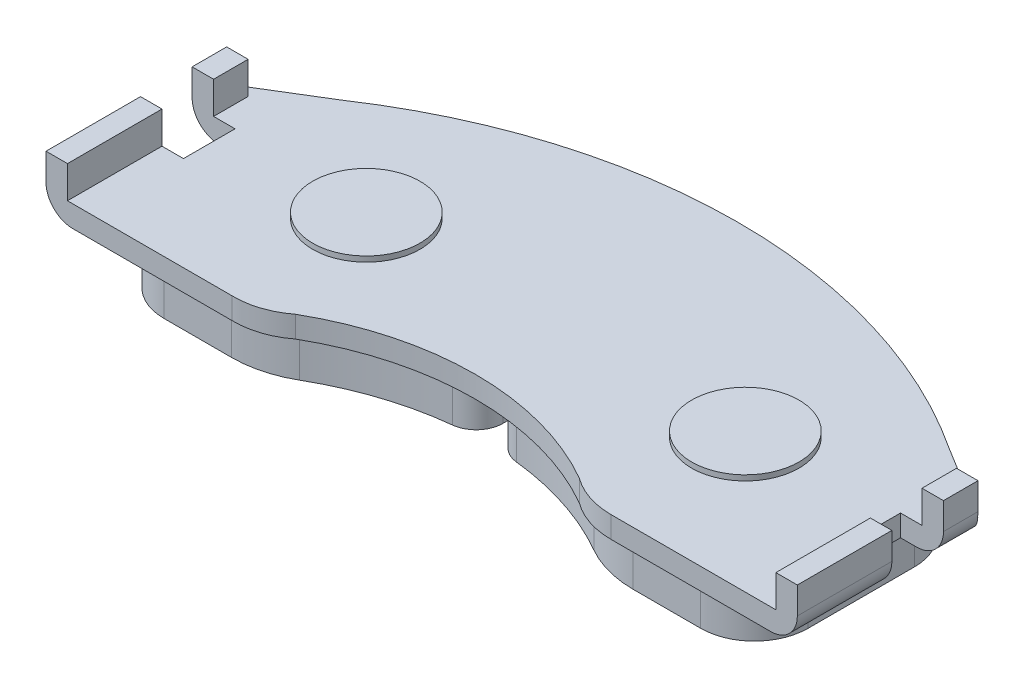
ISO-10303-21;
HEADER;
FILE_DESCRIPTION(('STEP AP214'),'2;1');
FILE_NAME('part.step','',(''),(''),'','','');
FILE_SCHEMA(('AUTOMOTIVE_DESIGN { 1 0 10303 214 1 1 1 1 }'));
ENDSEC;
DATA;
#1=APPLICATION_CONTEXT('core data for automotive mechanical design processes');
#2=APPLICATION_PROTOCOL_DEFINITION('international standard','automotive_design',2000,#1);
#3=PRODUCT_CONTEXT('',#1,'mechanical');
#4=PRODUCT('Part','Part','',(#3));
#5=PRODUCT_RELATED_PRODUCT_CATEGORY('part','',(#4));
#6=PRODUCT_DEFINITION_FORMATION('','',#4);
#7=PRODUCT_DEFINITION_CONTEXT('part definition',#1,'design');
#8=PRODUCT_DEFINITION('design','',#6,#7);
#9=PRODUCT_DEFINITION_SHAPE('','',#8);
#10=(LENGTH_UNIT() NAMED_UNIT(*) SI_UNIT(.MILLI.,.METRE.));
#11=(NAMED_UNIT(*) PLANE_ANGLE_UNIT() SI_UNIT($,.RADIAN.));
#12=(NAMED_UNIT(*) SI_UNIT($,.STERADIAN.) SOLID_ANGLE_UNIT());
#13=UNCERTAINTY_MEASURE_WITH_UNIT(LENGTH_MEASURE(1.E-05),#10,'distance_accuracy_value','');
#14=(GEOMETRIC_REPRESENTATION_CONTEXT(3) GLOBAL_UNCERTAINTY_ASSIGNED_CONTEXT((#13)) GLOBAL_UNIT_ASSIGNED_CONTEXT((#10,
#11,#12)) REPRESENTATION_CONTEXT('',''));
#15=CARTESIAN_POINT('',(0.,0.,0.));
#16=DIRECTION('',(0.,0.,1.));
#17=DIRECTION('',(1.,0.,0.));
#18=AXIS2_PLACEMENT_3D('',#15,#16,#17);
#19=CARTESIAN_POINT('',(-35.0112961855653,12.,19.6938332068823));
#20=DIRECTION('',(0.,1.,0.));
#21=DIRECTION('',(0.,0.,1.));
#22=AXIS2_PLACEMENT_3D('',#19,#20,#21);
#23=PLANE('',#22);
#24=CARTESIAN_POINT('',(35.3121854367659,12.,8.66481724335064));
#25=DIRECTION('',(0.,1.,0.));
#26=DIRECTION('',(0.,0.,1.));
#27=AXIS2_PLACEMENT_3D('',#24,#25,#26);
#28=CIRCLE('',#27,10.);
#29=CARTESIAN_POINT('',(35.3121854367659,12.,18.6648172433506));
#30=VERTEX_POINT('',#29);
#31=EDGE_CURVE('E11',#30,#30,#28,.T.);
#32=ORIENTED_EDGE('',*,*,#31,.F.);
#33=EDGE_LOOP('',(#32));
#34=FACE_BOUND('',#33,.T.);
#35=CARTESIAN_POINT('',(-35.3121854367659,12.,8.66481724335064));
#36=DIRECTION('',(0.,1.,0.));
#37=DIRECTION('',(0.,0.,1.));
#38=AXIS2_PLACEMENT_3D('',#35,#36,#37);
#39=CIRCLE('',#38,10.);
#40=CARTESIAN_POINT('',(-35.3121854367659,12.,18.6648172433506));
#41=VERTEX_POINT('',#40);
#42=EDGE_CURVE('E1378',#41,#41,#39,.T.);
#43=ORIENTED_EDGE('',*,*,#42,.F.);
#44=EDGE_LOOP('',(#43));
#45=FACE_BOUND('',#44,.T.);
#46=DIRECTION('',(1.,0.,0.));
#47=VECTOR('',#46,1.);
#48=CARTESIAN_POINT('',(70.,12.,0.));
#49=LINE('',#48,#47);
#50=CARTESIAN_POINT('',(66.,12.,0.));
#51=VERTEX_POINT('',#50);
#52=CARTESIAN_POINT('',(69.8989794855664,12.,0.));
#53=VERTEX_POINT('',#52);
#54=EDGE_CURVE('E402',#51,#53,#49,.T.);
#55=ORIENTED_EDGE('',*,*,#54,.T.);
#56=DIRECTION('',(0.,0.,-1.));
#57=VECTOR('',#56,1.);
#58=CARTESIAN_POINT('',(69.8989794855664,12.,0.));
#59=LINE('',#58,#57);
#60=CARTESIAN_POINT('',(69.8989794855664,12.,-0.0619426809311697));
#61=VERTEX_POINT('',#60);
#62=EDGE_CURVE('E751',#53,#61,#59,.T.);
#63=ORIENTED_EDGE('',*,*,#62,.T.);
#64=DIRECTION('',(-0.852500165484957,0.,-0.522726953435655));
#65=VECTOR('',#64,1.);
#66=CARTESIAN_POINT('',(56.0761824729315,12.,-8.5376578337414));
#67=LINE('',#66,#65);
#68=CARTESIAN_POINT('',(56.0761824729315,12.,-8.5376578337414));
#69=VERTEX_POINT('',#68);
#70=EDGE_CURVE('E510',#61,#69,#67,.T.);
#71=ORIENTED_EDGE('',*,*,#70,.T.);
#72=CARTESIAN_POINT('',(0.,12.,76.6648172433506));
#73=DIRECTION('',(0.,1.,0.));
#74=DIRECTION('',(0.,0.,1.));
#75=AXIS2_PLACEMENT_3D('',#72,#73,#74);
#76=CIRCLE('',#75,102.);
#77=CARTESIAN_POINT('',(-56.6666666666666,12.,-8.14608352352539));
#78=VERTEX_POINT('',#77);
#79=EDGE_CURVE('E512',#69,#78,#76,.T.);
#80=ORIENTED_EDGE('',*,*,#79,.T.);
#81=DIRECTION('',(-0.853340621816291,0.,0.521353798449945));
#82=VECTOR('',#81,1.);
#83=CARTESIAN_POINT('',(-56.6666666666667,12.,-8.14608352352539));
#84=LINE('',#83,#82);
#85=CARTESIAN_POINT('',(-69.8989794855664,12.,-0.0617191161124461));
#86=VERTEX_POINT('',#85);
#87=EDGE_CURVE('E484',#78,#86,#84,.T.);
#88=ORIENTED_EDGE('',*,*,#87,.T.);
#89=DIRECTION('',(0.,0.,1.));
#90=VECTOR('',#89,1.);
#91=CARTESIAN_POINT('',(-69.8989794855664,12.,-0.0617191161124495));
#92=LINE('',#91,#90);
#93=CARTESIAN_POINT('',(-69.8989794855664,12.,0.));
#94=VERTEX_POINT('',#93);
#95=EDGE_CURVE('E735',#86,#94,#92,.T.);
#96=ORIENTED_EDGE('',*,*,#95,.T.);
#97=DIRECTION('',(-1.,0.,0.));
#98=VECTOR('',#97,1.);
#99=CARTESIAN_POINT('',(-70.,12.,0.));
#100=LINE('',#99,#98);
#101=CARTESIAN_POINT('',(-66.,12.,0.));
#102=VERTEX_POINT('',#101);
#103=EDGE_CURVE('E452',#102,#94,#100,.T.);
#104=ORIENTED_EDGE('',*,*,#103,.F.);
#105=DIRECTION('',(0.,0.,-1.));
#106=VECTOR('',#105,1.);
#107=CARTESIAN_POINT('',(-66.,12.,0.));
#108=LINE('',#107,#106);
#109=CARTESIAN_POINT('',(-66.,12.,6.43707608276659));
#110=VERTEX_POINT('',#109);
#111=EDGE_CURVE('E447',#110,#102,#108,.T.);
#112=ORIENTED_EDGE('',*,*,#111,.F.);
#113=DIRECTION('',(1.,0.,0.));
#114=VECTOR('',#113,1.);
#115=CARTESIAN_POINT('',(-70.,12.,6.43707608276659));
#116=LINE('',#115,#114);
#117=CARTESIAN_POINT('',(-62.,12.,6.43707608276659));
#118=VERTEX_POINT('',#117);
#119=EDGE_CURVE('E487',#110,#118,#116,.T.);
#120=ORIENTED_EDGE('',*,*,#119,.T.);
#121=DIRECTION('',(0.,0.,1.));
#122=VECTOR('',#121,1.);
#123=CARTESIAN_POINT('',(-62.,12.,6.43707608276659));
#124=LINE('',#123,#122);
#125=CARTESIAN_POINT('',(-62.,12.,16.0504788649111));
#126=VERTEX_POINT('',#125);
#127=EDGE_CURVE('E490',#118,#126,#124,.T.);
#128=ORIENTED_EDGE('',*,*,#127,.T.);
#129=DIRECTION('',(-1.,0.,0.));
#130=VECTOR('',#129,1.);
#131=CARTESIAN_POINT('',(-62.,12.,16.0504788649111));
#132=LINE('',#131,#130);
#133=CARTESIAN_POINT('',(-66.,12.,16.0504788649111));
#134=VERTEX_POINT('',#133);
#135=EDGE_CURVE('E492',#126,#134,#132,.T.);
#136=ORIENTED_EDGE('',*,*,#135,.T.);
#137=DIRECTION('',(0.,0.,-1.));
#138=VECTOR('',#137,1.);
#139=CARTESIAN_POINT('',(-66.,12.,16.0504788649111));
#140=LINE('',#139,#138);
#141=CARTESIAN_POINT('',(-66.,12.,33.6648172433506));
#142=VERTEX_POINT('',#141);
#143=EDGE_CURVE('E428',#142,#134,#140,.T.);
#144=ORIENTED_EDGE('',*,*,#143,.F.);
#145=DIRECTION('',(1.,0.,0.));
#146=VECTOR('',#145,1.);
#147=CARTESIAN_POINT('',(-70.,12.,33.6648172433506));
#148=LINE('',#147,#146);
#149=CARTESIAN_POINT('',(-35.3121854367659,12.,33.6648172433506));
#150=VERTEX_POINT('',#149);
#151=EDGE_CURVE('E494',#142,#150,#148,.T.);
#152=ORIENTED_EDGE('',*,*,#151,.T.);
#153=CARTESIAN_POINT('',(-35.0112961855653,12.,19.6938332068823));
#154=DIRECTION('',(0.,1.,0.));
#155=DIRECTION('',(0.,0.,1.));
#156=AXIS2_PLACEMENT_3D('',#153,#154,#155);
#157=CIRCLE('',#156,13.9742237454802);
#158=CARTESIAN_POINT('',(-26.4410455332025,12.,30.7314839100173));
#159=VERTEX_POINT('',#158);
#160=EDGE_CURVE('E496',#150,#159,#157,.T.);
#161=ORIENTED_EDGE('',*,*,#160,.T.);
#162=CARTESIAN_POINT('',(0.,12.,76.6648172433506));
#163=DIRECTION('',(0.,-1.,0.));
#164=DIRECTION('',(0.,0.,1.));
#165=AXIS2_PLACEMENT_3D('',#162,#163,#164);
#166=CIRCLE('',#165,53.);
#167=CARTESIAN_POINT('',(26.4410455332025,12.,30.7314839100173));
#168=VERTEX_POINT('',#167);
#169=EDGE_CURVE('E498',#159,#168,#166,.T.);
#170=ORIENTED_EDGE('',*,*,#169,.T.);
#171=CARTESIAN_POINT('',(35.3121854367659,12.,18.7838682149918));
#172=DIRECTION('',(0.,1.,0.));
#173=DIRECTION('',(0.,0.,1.));
#174=AXIS2_PLACEMENT_3D('',#171,#172,#173);
#175=CIRCLE('',#174,14.8809490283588);
#176=CARTESIAN_POINT('',(35.3121854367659,12.,33.6648172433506));
#177=VERTEX_POINT('',#176);
#178=EDGE_CURVE('E500',#168,#177,#175,.T.);
#179=ORIENTED_EDGE('',*,*,#178,.T.);
#180=DIRECTION('',(1.,0.,0.));
#181=VECTOR('',#180,1.);
#182=CARTESIAN_POINT('',(70.,12.,33.6648172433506));
#183=LINE('',#182,#181);
#184=CARTESIAN_POINT('',(66.,12.,33.6648172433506));
#185=VERTEX_POINT('',#184);
#186=EDGE_CURVE('E502',#177,#185,#183,.T.);
#187=ORIENTED_EDGE('',*,*,#186,.T.);
#188=DIRECTION('',(0.,0.,-1.));
#189=VECTOR('',#188,1.);
#190=CARTESIAN_POINT('',(66.,12.,16.0504788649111));
#191=LINE('',#190,#189);
#192=CARTESIAN_POINT('',(66.,12.,16.0504788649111));
#193=VERTEX_POINT('',#192);
#194=EDGE_CURVE('E384',#185,#193,#191,.T.);
#195=ORIENTED_EDGE('',*,*,#194,.T.);
#196=DIRECTION('',(-1.,0.,0.));
#197=VECTOR('',#196,1.);
#198=CARTESIAN_POINT('',(62.,12.,16.0504788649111));
#199=LINE('',#198,#197);
#200=CARTESIAN_POINT('',(62.,12.,16.0504788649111));
#201=VERTEX_POINT('',#200);
#202=EDGE_CURVE('E504',#193,#201,#199,.T.);
#203=ORIENTED_EDGE('',*,*,#202,.T.);
#204=DIRECTION('',(0.,0.,-1.));
#205=VECTOR('',#204,1.);
#206=CARTESIAN_POINT('',(62.,12.,6.43707608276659));
#207=LINE('',#206,#205);
#208=CARTESIAN_POINT('',(62.,12.,6.43707608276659));
#209=VERTEX_POINT('',#208);
#210=EDGE_CURVE('E506',#201,#209,#207,.T.);
#211=ORIENTED_EDGE('',*,*,#210,.T.);
#212=DIRECTION('',(1.,0.,0.));
#213=VECTOR('',#212,1.);
#214=CARTESIAN_POINT('',(70.,12.,6.43707608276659));
#215=LINE('',#214,#213);
#216=CARTESIAN_POINT('',(66.,12.,6.43707608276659));
#217=VERTEX_POINT('',#216);
#218=EDGE_CURVE('E508',#209,#217,#215,.T.);
#219=ORIENTED_EDGE('',*,*,#218,.T.);
#220=DIRECTION('',(0.,0.,-1.));
#221=VECTOR('',#220,1.);
#222=CARTESIAN_POINT('',(66.,12.,0.));
#223=LINE('',#222,#221);
#224=EDGE_CURVE('E407',#217,#51,#223,.T.);
#225=ORIENTED_EDGE('',*,*,#224,.T.);
#226=EDGE_LOOP('',(#55,#63,#71,#80,#88,#96,#104,#112,#120,#128,#136,#144,#152,#161,#170,#179,
#187,#195,#203,#211,#219,#225));
#227=FACE_BOUND('',#226,.T.);
#228=ADVANCED_FACE('F35',(#34,#45,#227),#23,.T.);
#229=CARTESIAN_POINT('',(0.,8.,76.6648172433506));
#230=DIRECTION('',(0.,-1.,0.));
#231=DIRECTION('',(0.,0.,-1.));
#232=AXIS2_PLACEMENT_3D('',#229,#230,#231);
#233=CYLINDRICAL_SURFACE('',#232,55.);
#234=CARTESIAN_POINT('',(0.,0.,76.6648172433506));
#235=DIRECTION('',(0.,-1.,0.));
#236=DIRECTION('',(0.,0.,-1.));
#237=AXIS2_PLACEMENT_3D('',#234,#235,#236);
#238=CIRCLE('',#237,55.);
#239=CARTESIAN_POINT('',(-27.4388208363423,0.,28.998150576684));
#240=VERTEX_POINT('',#239);
#241=CARTESIAN_POINT('',(-5.95833333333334,0.,21.9885128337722));
#242=VERTEX_POINT('',#241);
#243=EDGE_CURVE('E633',#240,#242,#238,.T.);
#244=ORIENTED_EDGE('',*,*,#243,.T.);
#245=DIRECTION('',(0.,-1.,0.));
#246=VECTOR('',#245,1.);
#247=CARTESIAN_POINT('',(-5.95833333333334,8.,21.9885128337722));
#248=LINE('',#247,#246);
#249=CARTESIAN_POINT('',(-5.95833333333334,8.,21.9885128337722));
#250=VERTEX_POINT('',#249);
#251=EDGE_CURVE('E710',#242,#250,#248,.F.);
#252=ORIENTED_EDGE('',*,*,#251,.T.);
#253=CARTESIAN_POINT('',(0.,8.,76.6648172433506));
#254=DIRECTION('',(0.,-1.,0.));
#255=DIRECTION('',(0.,0.,-1.));
#256=AXIS2_PLACEMENT_3D('',#253,#254,#255);
#257=CIRCLE('',#256,55.);
#258=CARTESIAN_POINT('',(-27.4388208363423,8.,28.998150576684));
#259=VERTEX_POINT('',#258);
#260=EDGE_CURVE('E597',#259,#250,#257,.T.);
#261=ORIENTED_EDGE('',*,*,#260,.F.);
#262=DIRECTION('',(0.,-1.,0.));
#263=VECTOR('',#262,1.);
#264=CARTESIAN_POINT('',(-27.4388208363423,8.,28.998150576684));
#265=LINE('',#264,#263);
#266=EDGE_CURVE('E679',#259,#240,#265,.T.);
#267=ORIENTED_EDGE('',*,*,#266,.T.);
#268=EDGE_LOOP('',(#244,#252,#261,#267));
#269=FACE_BOUND('',#268,.T.);
#270=ADVANCED_FACE('F783',(#269),#233,.F.);
#271=CARTESIAN_POINT('',(0.,8.,76.6648172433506));
#272=DIRECTION('',(0.,-1.,0.));
#273=DIRECTION('',(0.,0.,-1.));
#274=AXIS2_PLACEMENT_3D('',#271,#272,#273);
#275=CYLINDRICAL_SURFACE('',#274,100.);
#276=CARTESIAN_POINT('',(0.,8.,76.6648172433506));
#277=DIRECTION('',(0.,1.,0.));
#278=DIRECTION('',(0.,0.,-1.));
#279=AXIS2_PLACEMENT_3D('',#276,#277,#278);
#280=CIRCLE('',#279,100.);
#281=CARTESIAN_POINT('',(-6.8421052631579,8.,-23.1008361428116));
#282=VERTEX_POINT('',#281);
#283=CARTESIAN_POINT('',(-55.5555555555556,8.,-6.48312468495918));
#284=VERTEX_POINT('',#283);
#285=EDGE_CURVE('E615',#282,#284,#280,.T.);
#286=ORIENTED_EDGE('',*,*,#285,.F.);
#287=DIRECTION('',(0.,-1.,0.));
#288=VECTOR('',#287,1.);
#289=CARTESIAN_POINT('',(-6.8421052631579,8.,-23.1008361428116));
#290=LINE('',#289,#288);
#291=CARTESIAN_POINT('',(-6.8421052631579,0.,-23.1008361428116));
#292=VERTEX_POINT('',#291);
#293=EDGE_CURVE('E688',#282,#292,#290,.T.);
#294=ORIENTED_EDGE('',*,*,#293,.T.);
#295=CARTESIAN_POINT('',(0.,0.,76.6648172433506));
#296=DIRECTION('',(0.,1.,0.));
#297=DIRECTION('',(0.,0.,-1.));
#298=AXIS2_PLACEMENT_3D('',#295,#296,#297);
#299=CIRCLE('',#298,100.);
#300=CARTESIAN_POINT('',(-55.5555555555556,0.,-6.48312468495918));
#301=VERTEX_POINT('',#300);
#302=EDGE_CURVE('E646',#292,#301,#299,.T.);
#303=ORIENTED_EDGE('',*,*,#302,.T.);
#304=DIRECTION('',(0.,-1.,0.));
#305=VECTOR('',#304,1.);
#306=CARTESIAN_POINT('',(-55.5555555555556,8.,-6.48312468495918));
#307=LINE('',#306,#305);
#308=EDGE_CURVE('E658',#284,#301,#307,.T.);
#309=ORIENTED_EDGE('',*,*,#308,.F.);
#310=EDGE_LOOP('',(#286,#294,#303,#309));
#311=FACE_BOUND('',#310,.T.);
#312=ADVANCED_FACE('F789',(#311),#275,.T.);
#313=CARTESIAN_POINT('',(-50.,0.,21.6648172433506));
#314=DIRECTION('',(0.,1.,0.));
#315=DIRECTION('',(0.,0.,1.));
#316=AXIS2_PLACEMENT_3D('',#313,#314,#315);
#317=PLANE('',#316);
#318=ORIENTED_EDGE('',*,*,#302,.F.);
#319=CARTESIAN_POINT('',(-6.50000000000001,0.,-18.1125534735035));
#320=DIRECTION('',(0.,1.,0.));
#321=DIRECTION('',(0.,0.,1.));
#322=AXIS2_PLACEMENT_3D('',#319,#320,#321);
#323=CIRCLE('',#322,5.);
#324=CARTESIAN_POINT('',(-1.5,0.,-18.1125534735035));
#325=VERTEX_POINT('',#324);
#326=EDGE_CURVE('E693',#292,#325,#323,.F.);
#327=ORIENTED_EDGE('',*,*,#326,.T.);
#328=DIRECTION('',(0.,0.,1.));
#329=VECTOR('',#328,1.);
#330=CARTESIAN_POINT('',(-1.5,0.,-25.3351827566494));
#331=LINE('',#330,#329);
#332=CARTESIAN_POINT('',(-1.5,0.,17.0179397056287));
#333=VERTEX_POINT('',#332);
#334=EDGE_CURVE('E471',#325,#333,#331,.T.);
#335=ORIENTED_EDGE('',*,*,#334,.T.);
#336=CARTESIAN_POINT('',(-6.50000000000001,0.,17.0179397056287));
#337=DIRECTION('',(0.,1.,0.));
#338=DIRECTION('',(0.,0.,1.));
#339=AXIS2_PLACEMENT_3D('',#336,#337,#338);
#340=CIRCLE('',#339,5.);
#341=EDGE_CURVE('E691',#333,#242,#340,.F.);
#342=ORIENTED_EDGE('',*,*,#341,.T.);
#343=ORIENTED_EDGE('',*,*,#243,.F.);
#344=CARTESIAN_POINT('',(-37.4165738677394,0.,11.6648172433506));
#345=DIRECTION('',(0.,1.,0.));
#346=DIRECTION('',(0.,0.,1.));
#347=AXIS2_PLACEMENT_3D('',#344,#345,#346);
#348=CIRCLE('',#347,20.);
#349=CARTESIAN_POINT('',(-37.4165738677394,0.,31.6648172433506));
#350=VERTEX_POINT('',#349);
#351=EDGE_CURVE('E630',#350,#240,#348,.T.);
#352=ORIENTED_EDGE('',*,*,#351,.F.);
#353=DIRECTION('',(1.,0.,0.));
#354=VECTOR('',#353,1.);
#355=CARTESIAN_POINT('',(-50.,0.,31.6648172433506));
#356=LINE('',#355,#354);
#357=CARTESIAN_POINT('',(-50.,0.,31.6648172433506));
#358=VERTEX_POINT('',#357);
#359=EDGE_CURVE('E628',#358,#350,#356,.T.);
#360=ORIENTED_EDGE('',*,*,#359,.F.);
#361=CARTESIAN_POINT('',(-50.,0.,21.6648172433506));
#362=DIRECTION('',(0.,1.,0.));
#363=DIRECTION('',(0.,0.,1.));
#364=AXIS2_PLACEMENT_3D('',#361,#362,#363);
#365=CIRCLE('',#364,10.);
#366=CARTESIAN_POINT('',(-60.,0.,21.6648172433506));
#367=VERTEX_POINT('',#366);
#368=EDGE_CURVE('E585',#367,#358,#365,.T.);
#369=ORIENTED_EDGE('',*,*,#368,.F.);
#370=DIRECTION('',(0.,0.,1.));
#371=VECTOR('',#370,1.);
#372=CARTESIAN_POINT('',(-60.,0.,1.83166950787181));
#373=LINE('',#372,#371);
#374=CARTESIAN_POINT('',(-60.,0.,1.83166950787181));
#375=VERTEX_POINT('',#374);
#376=EDGE_CURVE('E590',#375,#367,#373,.T.);
#377=ORIENTED_EDGE('',*,*,#376,.F.);
#378=CARTESIAN_POINT('',(-50.,0.,1.83166950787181));
#379=DIRECTION('',(0.,1.,0.));
#380=DIRECTION('',(0.,0.,1.));
#381=AXIS2_PLACEMENT_3D('',#378,#379,#380);
#382=CIRCLE('',#381,10.);
#383=EDGE_CURVE('E650',#301,#375,#382,.T.);
#384=ORIENTED_EDGE('',*,*,#383,.F.);
#385=EDGE_LOOP('',(#318,#327,#335,#342,#343,#352,#360,#369,#377,#384));
#386=FACE_BOUND('',#385,.T.);
#387=ADVANCED_FACE('F874',(#386),#317,.F.);
#388=CARTESIAN_POINT('',(-50.,8.,21.6648172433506));
#389=DIRECTION('',(0.,-1.,0.));
#390=DIRECTION('',(0.,0.,-1.));
#391=AXIS2_PLACEMENT_3D('',#388,#389,#390);
#392=CYLINDRICAL_SURFACE('',#391,10.);
#393=ORIENTED_EDGE('',*,*,#368,.T.);
#394=DIRECTION('',(0.,-1.,0.));
#395=VECTOR('',#394,1.);
#396=CARTESIAN_POINT('',(-50.,8.,31.6648172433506));
#397=LINE('',#396,#395);
#398=CARTESIAN_POINT('',(-50.,8.,31.6648172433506));
#399=VERTEX_POINT('',#398);
#400=EDGE_CURVE('E685',#399,#358,#397,.T.);
#401=ORIENTED_EDGE('',*,*,#400,.F.);
#402=CARTESIAN_POINT('',(-50.,8.,21.6648172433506));
#403=DIRECTION('',(0.,1.,0.));
#404=DIRECTION('',(0.,0.,1.));
#405=AXIS2_PLACEMENT_3D('',#402,#403,#404);
#406=CIRCLE('',#405,10.);
#407=CARTESIAN_POINT('',(-60.,8.,21.6648172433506));
#408=VERTEX_POINT('',#407);
#409=EDGE_CURVE('E586',#408,#399,#406,.T.);
#410=ORIENTED_EDGE('',*,*,#409,.F.);
#411=DIRECTION('',(0.,-1.,0.));
#412=VECTOR('',#411,1.);
#413=CARTESIAN_POINT('',(-60.,8.,21.6648172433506));
#414=LINE('',#413,#412);
#415=EDGE_CURVE('E625',#408,#367,#414,.T.);
#416=ORIENTED_EDGE('',*,*,#415,.T.);
#417=EDGE_LOOP('',(#393,#401,#410,#416));
#418=FACE_BOUND('',#417,.T.);
#419=ADVANCED_FACE('F915',(#418),#392,.T.);
#420=CARTESIAN_POINT('',(-50.,8.,31.6648172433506));
#421=DIRECTION('',(0.,0.,-1.));
#422=DIRECTION('',(-1.,0.,0.));
#423=AXIS2_PLACEMENT_3D('',#420,#421,#422);
#424=PLANE('',#423);
#425=ORIENTED_EDGE('',*,*,#359,.T.);
#426=DIRECTION('',(0.,-1.,0.));
#427=VECTOR('',#426,1.);
#428=CARTESIAN_POINT('',(-37.4165738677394,8.,31.6648172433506));
#429=LINE('',#428,#427);
#430=CARTESIAN_POINT('',(-37.4165738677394,8.,31.6648172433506));
#431=VERTEX_POINT('',#430);
#432=EDGE_CURVE('E682',#431,#350,#429,.T.);
#433=ORIENTED_EDGE('',*,*,#432,.F.);
#434=DIRECTION('',(1.,0.,0.));
#435=VECTOR('',#434,1.);
#436=CARTESIAN_POINT('',(-50.,8.,31.6648172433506));
#437=LINE('',#436,#435);
#438=EDGE_CURVE('E589',#399,#431,#437,.T.);
#439=ORIENTED_EDGE('',*,*,#438,.F.);
#440=ORIENTED_EDGE('',*,*,#400,.T.);
#441=EDGE_LOOP('',(#425,#433,#439,#440));
#442=FACE_BOUND('',#441,.T.);
#443=ADVANCED_FACE('F911',(#442),#424,.F.);
#444=CARTESIAN_POINT('',(-37.4165738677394,8.,11.6648172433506));
#445=DIRECTION('',(0.,-1.,0.));
#446=DIRECTION('',(0.,0.,-1.));
#447=AXIS2_PLACEMENT_3D('',#444,#445,#446);
#448=CYLINDRICAL_SURFACE('',#447,20.);
#449=ORIENTED_EDGE('',*,*,#351,.T.);
#450=ORIENTED_EDGE('',*,*,#266,.F.);
#451=CARTESIAN_POINT('',(-37.4165738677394,8.,11.6648172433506));
#452=DIRECTION('',(0.,1.,0.));
#453=DIRECTION('',(0.,0.,1.));
#454=AXIS2_PLACEMENT_3D('',#451,#452,#453);
#455=CIRCLE('',#454,20.);
#456=EDGE_CURVE('E593',#431,#259,#455,.T.);
#457=ORIENTED_EDGE('',*,*,#456,.F.);
#458=ORIENTED_EDGE('',*,*,#432,.T.);
#459=EDGE_LOOP('',(#449,#450,#457,#458));
#460=FACE_BOUND('',#459,.T.);
#461=ADVANCED_FACE('F907',(#460),#448,.T.);
#462=CARTESIAN_POINT('',(5.95833333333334,8.,21.9885128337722));
#463=VERTEX_POINT('',#462);
#464=CARTESIAN_POINT('',(27.4388208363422,8.,28.998150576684));
#465=VERTEX_POINT('',#464);
#466=EDGE_CURVE('E596',#463,#465,#257,.T.);
#467=ORIENTED_EDGE('',*,*,#466,.F.);
#468=DIRECTION('',(0.,-1.,0.));
#469=VECTOR('',#468,1.);
#470=CARTESIAN_POINT('',(5.95833333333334,8.,21.9885128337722));
#471=LINE('',#470,#469);
#472=CARTESIAN_POINT('',(5.95833333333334,0.,21.9885128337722));
#473=VERTEX_POINT('',#472);
#474=EDGE_CURVE('E713',#463,#473,#471,.T.);
#475=ORIENTED_EDGE('',*,*,#474,.T.);
#476=CARTESIAN_POINT('',(27.4388208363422,0.,28.998150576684));
#477=VERTEX_POINT('',#476);
#478=EDGE_CURVE('E632',#473,#477,#238,.T.);
#479=ORIENTED_EDGE('',*,*,#478,.T.);
#480=DIRECTION('',(0.,-1.,0.));
#481=VECTOR('',#480,1.);
#482=CARTESIAN_POINT('',(27.4388208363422,8.,28.998150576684));
#483=LINE('',#482,#481);
#484=EDGE_CURVE('E676',#465,#477,#483,.T.);
#485=ORIENTED_EDGE('',*,*,#484,.F.);
#486=EDGE_LOOP('',(#467,#475,#479,#485));
#487=FACE_BOUND('',#486,.T.);
#488=ADVANCED_FACE('F792',(#487),#233,.F.);
#489=CARTESIAN_POINT('',(37.4165738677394,8.,11.6648172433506));
#490=DIRECTION('',(0.,-1.,0.));
#491=DIRECTION('',(0.,0.,-1.));
#492=AXIS2_PLACEMENT_3D('',#489,#490,#491);
#493=CYLINDRICAL_SURFACE('',#492,20.);
#494=CARTESIAN_POINT('',(37.4165738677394,0.,11.6648172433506));
#495=DIRECTION('',(0.,1.,0.));
#496=DIRECTION('',(0.,0.,-1.));
#497=AXIS2_PLACEMENT_3D('',#494,#495,#496);
#498=CIRCLE('',#497,20.);
#499=CARTESIAN_POINT('',(37.4165738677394,0.,31.6648172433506));
#500=VERTEX_POINT('',#499);
#501=EDGE_CURVE('E636',#477,#500,#498,.T.);
#502=ORIENTED_EDGE('',*,*,#501,.T.);
#503=DIRECTION('',(0.,-1.,0.));
#504=VECTOR('',#503,1.);
#505=CARTESIAN_POINT('',(37.4165738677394,8.,31.6648172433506));
#506=LINE('',#505,#504);
#507=CARTESIAN_POINT('',(37.4165738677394,8.,31.6648172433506));
#508=VERTEX_POINT('',#507);
#509=EDGE_CURVE('E673',#508,#500,#506,.T.);
#510=ORIENTED_EDGE('',*,*,#509,.F.);
#511=CARTESIAN_POINT('',(37.4165738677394,8.,11.6648172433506));
#512=DIRECTION('',(0.,1.,0.));
#513=DIRECTION('',(0.,0.,-1.));
#514=AXIS2_PLACEMENT_3D('',#511,#512,#513);
#515=CIRCLE('',#514,20.);
#516=EDGE_CURVE('E600',#465,#508,#515,.T.);
#517=ORIENTED_EDGE('',*,*,#516,.F.);
#518=ORIENTED_EDGE('',*,*,#484,.T.);
#519=EDGE_LOOP('',(#502,#510,#517,#518));
#520=FACE_BOUND('',#519,.T.);
#521=ADVANCED_FACE('F901',(#520),#493,.T.);
#522=CARTESIAN_POINT('',(50.,8.,31.6648172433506));
#523=DIRECTION('',(0.,0.,-1.));
#524=DIRECTION('',(-1.,0.,0.));
#525=AXIS2_PLACEMENT_3D('',#522,#523,#524);
#526=PLANE('',#525);
#527=DIRECTION('',(1.,0.,0.));
#528=VECTOR('',#527,1.);
#529=CARTESIAN_POINT('',(50.,0.,31.6648172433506));
#530=LINE('',#529,#528);
#531=CARTESIAN_POINT('',(50.,0.,31.6648172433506));
#532=VERTEX_POINT('',#531);
#533=EDGE_CURVE('E638',#500,#532,#530,.T.);
#534=ORIENTED_EDGE('',*,*,#533,.T.);
#535=DIRECTION('',(0.,-1.,0.));
#536=VECTOR('',#535,1.);
#537=CARTESIAN_POINT('',(50.,8.,31.6648172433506));
#538=LINE('',#537,#536);
#539=CARTESIAN_POINT('',(50.,8.,31.6648172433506));
#540=VERTEX_POINT('',#539);
#541=EDGE_CURVE('E670',#540,#532,#538,.T.);
#542=ORIENTED_EDGE('',*,*,#541,.F.);
#543=DIRECTION('',(1.,0.,0.));
#544=VECTOR('',#543,1.);
#545=CARTESIAN_POINT('',(50.,8.,31.6648172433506));
#546=LINE('',#545,#544);
#547=EDGE_CURVE('E603',#508,#540,#546,.T.);
#548=ORIENTED_EDGE('',*,*,#547,.F.);
#549=ORIENTED_EDGE('',*,*,#509,.T.);
#550=EDGE_LOOP('',(#534,#542,#548,#549));
#551=FACE_BOUND('',#550,.T.);
#552=ADVANCED_FACE('F897',(#551),#526,.F.);
#553=CARTESIAN_POINT('',(50.,8.,21.6648172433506));
#554=DIRECTION('',(0.,-1.,0.));
#555=DIRECTION('',(0.,0.,-1.));
#556=AXIS2_PLACEMENT_3D('',#553,#554,#555);
#557=CYLINDRICAL_SURFACE('',#556,9.99999999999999);
#558=CARTESIAN_POINT('',(50.,0.,21.6648172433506));
#559=DIRECTION('',(0.,1.,0.));
#560=DIRECTION('',(0.,0.,-1.));
#561=AXIS2_PLACEMENT_3D('',#558,#559,#560);
#562=CIRCLE('',#561,9.99999999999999);
#563=CARTESIAN_POINT('',(60.,0.,21.6648172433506));
#564=VERTEX_POINT('',#563);
#565=EDGE_CURVE('E640',#532,#564,#562,.T.);
#566=ORIENTED_EDGE('',*,*,#565,.T.);
#567=DIRECTION('',(0.,-1.,0.));
#568=VECTOR('',#567,1.);
#569=CARTESIAN_POINT('',(60.,8.,21.6648172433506));
#570=LINE('',#569,#568);
#571=CARTESIAN_POINT('',(60.,8.,21.6648172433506));
#572=VERTEX_POINT('',#571);
#573=EDGE_CURVE('E667',#572,#564,#570,.T.);
#574=ORIENTED_EDGE('',*,*,#573,.F.);
#575=CARTESIAN_POINT('',(50.,8.,21.6648172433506));
#576=DIRECTION('',(0.,1.,0.));
#577=DIRECTION('',(0.,0.,-1.));
#578=AXIS2_PLACEMENT_3D('',#575,#576,#577);
#579=CIRCLE('',#578,9.99999999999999);
#580=EDGE_CURVE('E606',#540,#572,#579,.T.);
#581=ORIENTED_EDGE('',*,*,#580,.F.);
#582=ORIENTED_EDGE('',*,*,#541,.T.);
#583=EDGE_LOOP('',(#566,#574,#581,#582));
#584=FACE_BOUND('',#583,.T.);
#585=ADVANCED_FACE('F893',(#584),#557,.T.);
#586=CARTESIAN_POINT('',(60.,8.,1.83166950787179));
#587=DIRECTION('',(-1.,0.,0.));
#588=DIRECTION('',(0.,0.,1.));
#589=AXIS2_PLACEMENT_3D('',#586,#587,#588);
#590=PLANE('',#589);
#591=DIRECTION('',(0.,0.,-1.));
#592=VECTOR('',#591,1.);
#593=CARTESIAN_POINT('',(60.,0.,1.83166950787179));
#594=LINE('',#593,#592);
#595=CARTESIAN_POINT('',(60.,0.,1.83166950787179));
#596=VERTEX_POINT('',#595);
#597=EDGE_CURVE('E642',#564,#596,#594,.T.);
#598=ORIENTED_EDGE('',*,*,#597,.T.);
#599=DIRECTION('',(0.,-1.,0.));
#600=VECTOR('',#599,1.);
#601=CARTESIAN_POINT('',(60.,8.,1.83166950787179));
#602=LINE('',#601,#600);
#603=CARTESIAN_POINT('',(60.,8.,1.83166950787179));
#604=VERTEX_POINT('',#603);
#605=EDGE_CURVE('E664',#604,#596,#602,.T.);
#606=ORIENTED_EDGE('',*,*,#605,.F.);
#607=DIRECTION('',(0.,0.,-1.));
#608=VECTOR('',#607,1.);
#609=CARTESIAN_POINT('',(60.,8.,1.83166950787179));
#610=LINE('',#609,#608);
#611=EDGE_CURVE('E609',#572,#604,#610,.T.);
#612=ORIENTED_EDGE('',*,*,#611,.F.);
#613=ORIENTED_EDGE('',*,*,#573,.T.);
#614=EDGE_LOOP('',(#598,#606,#612,#613));
#615=FACE_BOUND('',#614,.T.);
#616=ADVANCED_FACE('F889',(#615),#590,.F.);
#617=CARTESIAN_POINT('',(50.,8.,1.83166950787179));
#618=DIRECTION('',(0.,-1.,0.));
#619=DIRECTION('',(0.,0.,-1.));
#620=AXIS2_PLACEMENT_3D('',#617,#618,#619);
#621=CYLINDRICAL_SURFACE('',#620,10.);
#622=CARTESIAN_POINT('',(50.,0.,1.83166950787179));
#623=DIRECTION('',(0.,1.,0.));
#624=DIRECTION('',(0.,0.,1.));
#625=AXIS2_PLACEMENT_3D('',#622,#623,#624);
#626=CIRCLE('',#625,10.);
#627=CARTESIAN_POINT('',(55.5555555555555,0.,-6.48312468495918));
#628=VERTEX_POINT('',#627);
#629=EDGE_CURVE('E644',#596,#628,#626,.T.);
#630=ORIENTED_EDGE('',*,*,#629,.T.);
#631=DIRECTION('',(0.,-1.,0.));
#632=VECTOR('',#631,1.);
#633=CARTESIAN_POINT('',(55.5555555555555,8.,-6.48312468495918));
#634=LINE('',#633,#632);
#635=CARTESIAN_POINT('',(55.5555555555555,8.,-6.48312468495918));
#636=VERTEX_POINT('',#635);
#637=EDGE_CURVE('E661',#636,#628,#634,.T.);
#638=ORIENTED_EDGE('',*,*,#637,.F.);
#639=CARTESIAN_POINT('',(50.,8.,1.83166950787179));
#640=DIRECTION('',(0.,1.,0.));
#641=DIRECTION('',(0.,0.,1.));
#642=AXIS2_PLACEMENT_3D('',#639,#640,#641);
#643=CIRCLE('',#642,10.);
#644=EDGE_CURVE('E612',#604,#636,#643,.T.);
#645=ORIENTED_EDGE('',*,*,#644,.F.);
#646=ORIENTED_EDGE('',*,*,#605,.T.);
#647=EDGE_LOOP('',(#630,#638,#645,#646));
#648=FACE_BOUND('',#647,.T.);
#649=ADVANCED_FACE('F885',(#648),#621,.T.);
#650=CARTESIAN_POINT('',(6.8421052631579,0.,-23.1008361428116));
#651=VERTEX_POINT('',#650);
#652=EDGE_CURVE('E647',#628,#651,#299,.T.);
#653=ORIENTED_EDGE('',*,*,#652,.T.);
#654=DIRECTION('',(0.,-1.,0.));
#655=VECTOR('',#654,1.);
#656=CARTESIAN_POINT('',(6.8421052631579,8.,-23.1008361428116));
#657=LINE('',#656,#655);
#658=CARTESIAN_POINT('',(6.8421052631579,8.,-23.1008361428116));
#659=VERTEX_POINT('',#658);
#660=EDGE_CURVE('E699',#651,#659,#657,.F.);
#661=ORIENTED_EDGE('',*,*,#660,.T.);
#662=EDGE_CURVE('E616',#636,#659,#280,.T.);
#663=ORIENTED_EDGE('',*,*,#662,.F.);
#664=ORIENTED_EDGE('',*,*,#637,.T.);
#665=EDGE_LOOP('',(#653,#661,#663,#664));
#666=FACE_BOUND('',#665,.T.);
#667=ADVANCED_FACE('F881',(#666),#275,.T.);
#668=CARTESIAN_POINT('',(-50.,8.,1.83166950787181));
#669=DIRECTION('',(0.,-1.,0.));
#670=DIRECTION('',(0.,0.,-1.));
#671=AXIS2_PLACEMENT_3D('',#668,#669,#670);
#672=CYLINDRICAL_SURFACE('',#671,10.);
#673=ORIENTED_EDGE('',*,*,#383,.T.);
#674=DIRECTION('',(0.,-1.,0.));
#675=VECTOR('',#674,1.);
#676=CARTESIAN_POINT('',(-60.,8.,1.83166950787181));
#677=LINE('',#676,#675);
#678=CARTESIAN_POINT('',(-60.,8.,1.83166950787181));
#679=VERTEX_POINT('',#678);
#680=EDGE_CURVE('E655',#679,#375,#677,.T.);
#681=ORIENTED_EDGE('',*,*,#680,.F.);
#682=CARTESIAN_POINT('',(-50.,8.,1.83166950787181));
#683=DIRECTION('',(0.,1.,0.));
#684=DIRECTION('',(0.,0.,1.));
#685=AXIS2_PLACEMENT_3D('',#682,#683,#684);
#686=CIRCLE('',#685,10.);
#687=EDGE_CURVE('E619',#284,#679,#686,.T.);
#688=ORIENTED_EDGE('',*,*,#687,.F.);
#689=ORIENTED_EDGE('',*,*,#308,.T.);
#690=EDGE_LOOP('',(#673,#681,#688,#689));
#691=FACE_BOUND('',#690,.T.);
#692=ADVANCED_FACE('F877',(#691),#672,.T.);
#693=CARTESIAN_POINT('',(-60.,8.,1.83166950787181));
#694=DIRECTION('',(1.,0.,0.));
#695=DIRECTION('',(0.,0.,-1.));
#696=AXIS2_PLACEMENT_3D('',#693,#694,#695);
#697=PLANE('',#696);
#698=ORIENTED_EDGE('',*,*,#376,.T.);
#699=ORIENTED_EDGE('',*,*,#415,.F.);
#700=DIRECTION('',(0.,0.,1.));
#701=VECTOR('',#700,1.);
#702=CARTESIAN_POINT('',(-60.,8.,1.83166950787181));
#703=LINE('',#702,#701);
#704=EDGE_CURVE('E622',#679,#408,#703,.T.);
#705=ORIENTED_EDGE('',*,*,#704,.F.);
#706=ORIENTED_EDGE('',*,*,#680,.T.);
#707=EDGE_LOOP('',(#698,#699,#705,#706));
#708=FACE_BOUND('',#707,.T.);
#709=ADVANCED_FACE('F872',(#708),#697,.F.);
#710=DIRECTION('',(0.,0.,1.));
#711=VECTOR('',#710,1.);
#712=CARTESIAN_POINT('',(1.5,0.,-25.3351827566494));
#713=LINE('',#712,#711);
#714=CARTESIAN_POINT('',(1.5,0.,-18.1125534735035));
#715=VERTEX_POINT('',#714);
#716=CARTESIAN_POINT('',(1.5,0.,17.0179397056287));
#717=VERTEX_POINT('',#716);
#718=EDGE_CURVE('E479',#715,#717,#713,.T.);
#719=ORIENTED_EDGE('',*,*,#718,.F.);
#720=CARTESIAN_POINT('',(6.5,0.,-18.1125534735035));
#721=DIRECTION('',(0.,1.,0.));
#722=DIRECTION('',(0.,0.,1.));
#723=AXIS2_PLACEMENT_3D('',#720,#721,#722);
#724=CIRCLE('',#723,5.);
#725=EDGE_CURVE('E708',#715,#651,#724,.F.);
#726=ORIENTED_EDGE('',*,*,#725,.T.);
#727=ORIENTED_EDGE('',*,*,#652,.F.);
#728=ORIENTED_EDGE('',*,*,#629,.F.);
#729=ORIENTED_EDGE('',*,*,#597,.F.);
#730=ORIENTED_EDGE('',*,*,#565,.F.);
#731=ORIENTED_EDGE('',*,*,#533,.F.);
#732=ORIENTED_EDGE('',*,*,#501,.F.);
#733=ORIENTED_EDGE('',*,*,#478,.F.);
#734=CARTESIAN_POINT('',(6.5,0.,17.0179397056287));
#735=DIRECTION('',(0.,1.,0.));
#736=DIRECTION('',(0.,0.,1.));
#737=AXIS2_PLACEMENT_3D('',#734,#735,#736);
#738=CIRCLE('',#737,5.);
#739=EDGE_CURVE('E706',#473,#717,#738,.F.);
#740=ORIENTED_EDGE('',*,*,#739,.T.);
#741=EDGE_LOOP('',(#719,#726,#727,#728,#729,#730,#731,#732,#733,#740));
#742=FACE_BOUND('',#741,.T.);
#743=ADVANCED_FACE('F802',(#742),#317,.F.);
#744=CARTESIAN_POINT('',(-35.0112961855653,8.,19.6938332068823));
#745=DIRECTION('',(0.,1.,0.));
#746=DIRECTION('',(0.,0.,1.));
#747=AXIS2_PLACEMENT_3D('',#744,#745,#746);
#748=PLANE('',#747);
#749=ORIENTED_EDGE('',*,*,#662,.T.);
#750=CARTESIAN_POINT('',(6.5,8.,-18.1125534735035));
#751=DIRECTION('',(0.,1.,0.));
#752=DIRECTION('',(0.,0.,1.));
#753=AXIS2_PLACEMENT_3D('',#750,#751,#752);
#754=CIRCLE('',#753,5.);
#755=CARTESIAN_POINT('',(1.5,8.,-18.1125534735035));
#756=VERTEX_POINT('',#755);
#757=EDGE_CURVE('E718',#659,#756,#754,.T.);
#758=ORIENTED_EDGE('',*,*,#757,.T.);
#759=DIRECTION('',(0.,0.,1.));
#760=VECTOR('',#759,1.);
#761=CARTESIAN_POINT('',(1.5,8.,-25.3351827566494));
#762=LINE('',#761,#760);
#763=CARTESIAN_POINT('',(1.5,8.,17.0179397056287));
#764=VERTEX_POINT('',#763);
#765=EDGE_CURVE('E476',#756,#764,#762,.T.);
#766=ORIENTED_EDGE('',*,*,#765,.T.);
#767=CARTESIAN_POINT('',(6.5,8.,17.0179397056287));
#768=DIRECTION('',(0.,1.,0.));
#769=DIRECTION('',(0.,0.,1.));
#770=AXIS2_PLACEMENT_3D('',#767,#768,#769);
#771=CIRCLE('',#770,5.);
#772=EDGE_CURVE('E722',#764,#463,#771,.T.);
#773=ORIENTED_EDGE('',*,*,#772,.T.);
#774=ORIENTED_EDGE('',*,*,#466,.T.);
#775=ORIENTED_EDGE('',*,*,#516,.T.);
#776=ORIENTED_EDGE('',*,*,#547,.T.);
#777=ORIENTED_EDGE('',*,*,#580,.T.);
#778=ORIENTED_EDGE('',*,*,#611,.T.);
#779=ORIENTED_EDGE('',*,*,#644,.T.);
#780=EDGE_LOOP('',(#749,#758,#766,#773,#774,#775,#776,#777,#778,#779));
#781=FACE_BOUND('',#780,.T.);
#782=ORIENTED_EDGE('',*,*,#260,.T.);
#783=CARTESIAN_POINT('',(-6.50000000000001,8.,17.0179397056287));
#784=DIRECTION('',(0.,1.,0.));
#785=DIRECTION('',(0.,0.,1.));
#786=AXIS2_PLACEMENT_3D('',#783,#784,#785);
#787=CIRCLE('',#786,5.);
#788=CARTESIAN_POINT('',(-1.5,8.,17.0179397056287));
#789=VERTEX_POINT('',#788);
#790=EDGE_CURVE('E720',#250,#789,#787,.T.);
#791=ORIENTED_EDGE('',*,*,#790,.T.);
#792=DIRECTION('',(0.,0.,1.));
#793=VECTOR('',#792,1.);
#794=CARTESIAN_POINT('',(-1.5,8.,-25.3351827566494));
#795=LINE('',#794,#793);
#796=CARTESIAN_POINT('',(-1.5,8.,-18.1125534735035));
#797=VERTEX_POINT('',#796);
#798=EDGE_CURVE('E472',#797,#789,#795,.T.);
#799=ORIENTED_EDGE('',*,*,#798,.F.);
#800=CARTESIAN_POINT('',(-6.50000000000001,8.,-18.1125534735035));
#801=DIRECTION('',(0.,1.,0.));
#802=DIRECTION('',(0.,0.,1.));
#803=AXIS2_PLACEMENT_3D('',#800,#801,#802);
#804=CIRCLE('',#803,5.);
#805=EDGE_CURVE('E716',#797,#282,#804,.T.);
#806=ORIENTED_EDGE('',*,*,#805,.T.);
#807=ORIENTED_EDGE('',*,*,#285,.T.);
#808=ORIENTED_EDGE('',*,*,#687,.T.);
#809=ORIENTED_EDGE('',*,*,#704,.T.);
#810=ORIENTED_EDGE('',*,*,#409,.T.);
#811=ORIENTED_EDGE('',*,*,#438,.T.);
#812=ORIENTED_EDGE('',*,*,#456,.T.);
#813=EDGE_LOOP('',(#782,#791,#799,#806,#807,#808,#809,#810,#811,#812));
#814=FACE_BOUND('',#813,.T.);
#815=DIRECTION('',(-0.852500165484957,0.,-0.522726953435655));
#816=VECTOR('',#815,1.);
#817=CARTESIAN_POINT('',(56.0761824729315,8.,-8.5376578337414));
#818=LINE('',#817,#816);
#819=CARTESIAN_POINT('',(65.,8.,-3.065846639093));
#820=VERTEX_POINT('',#819);
#821=CARTESIAN_POINT('',(56.0761824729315,8.,-8.5376578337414));
#822=VERTEX_POINT('',#821);
#823=EDGE_CURVE('E541',#820,#822,#818,.T.);
#824=ORIENTED_EDGE('',*,*,#823,.F.);
#825=DIRECTION('',(0.,0.,-1.));
#826=VECTOR('',#825,1.);
#827=CARTESIAN_POINT('',(65.,8.,19.6938332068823));
#828=LINE('',#827,#826);
#829=CARTESIAN_POINT('',(65.,8.,6.43707608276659));
#830=VERTEX_POINT('',#829);
#831=EDGE_CURVE('E757',#820,#830,#828,.F.);
#832=ORIENTED_EDGE('',*,*,#831,.T.);
#833=DIRECTION('',(1.,0.,0.));
#834=VECTOR('',#833,1.);
#835=CARTESIAN_POINT('',(70.,8.,6.43707608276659));
#836=LINE('',#835,#834);
#837=CARTESIAN_POINT('',(62.,8.,6.43707608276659));
#838=VERTEX_POINT('',#837);
#839=EDGE_CURVE('E538',#838,#830,#836,.T.);
#840=ORIENTED_EDGE('',*,*,#839,.F.);
#841=DIRECTION('',(0.,0.,-1.));
#842=VECTOR('',#841,1.);
#843=CARTESIAN_POINT('',(62.,8.,6.43707608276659));
#844=LINE('',#843,#842);
#845=CARTESIAN_POINT('',(62.,8.,16.0504788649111));
#846=VERTEX_POINT('',#845);
#847=EDGE_CURVE('E536',#846,#838,#844,.T.);
#848=ORIENTED_EDGE('',*,*,#847,.F.);
#849=DIRECTION('',(-1.,0.,0.));
#850=VECTOR('',#849,1.);
#851=CARTESIAN_POINT('',(62.,8.,16.0504788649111));
#852=LINE('',#851,#850);
#853=CARTESIAN_POINT('',(65.,8.,16.0504788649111));
#854=VERTEX_POINT('',#853);
#855=EDGE_CURVE('E534',#854,#846,#852,.T.);
#856=ORIENTED_EDGE('',*,*,#855,.F.);
#857=DIRECTION('',(0.,0.,-1.));
#858=VECTOR('',#857,1.);
#859=CARTESIAN_POINT('',(65.,8.,19.6938332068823));
#860=LINE('',#859,#858);
#861=CARTESIAN_POINT('',(65.,8.,33.6648172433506));
#862=VERTEX_POINT('',#861);
#863=EDGE_CURVE('E755',#854,#862,#860,.F.);
#864=ORIENTED_EDGE('',*,*,#863,.T.);
#865=DIRECTION('',(1.,0.,0.));
#866=VECTOR('',#865,1.);
#867=CARTESIAN_POINT('',(70.,8.,33.6648172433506));
#868=LINE('',#867,#866);
#869=CARTESIAN_POINT('',(35.3121854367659,8.,33.6648172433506));
#870=VERTEX_POINT('',#869);
#871=EDGE_CURVE('E532',#870,#862,#868,.T.);
#872=ORIENTED_EDGE('',*,*,#871,.F.);
#873=CARTESIAN_POINT('',(35.3121854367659,8.,18.7838682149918));
#874=DIRECTION('',(0.,1.,0.));
#875=DIRECTION('',(0.,0.,1.));
#876=AXIS2_PLACEMENT_3D('',#873,#874,#875);
#877=CIRCLE('',#876,14.8809490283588);
#878=CARTESIAN_POINT('',(26.4410455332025,8.,30.7314839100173));
#879=VERTEX_POINT('',#878);
#880=EDGE_CURVE('E530',#879,#870,#877,.T.);
#881=ORIENTED_EDGE('',*,*,#880,.F.);
#882=CARTESIAN_POINT('',(0.,8.,76.6648172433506));
#883=DIRECTION('',(0.,-1.,0.));
#884=DIRECTION('',(0.,0.,1.));
#885=AXIS2_PLACEMENT_3D('',#882,#883,#884);
#886=CIRCLE('',#885,53.);
#887=CARTESIAN_POINT('',(-26.4410455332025,8.,30.7314839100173));
#888=VERTEX_POINT('',#887);
#889=EDGE_CURVE('E528',#888,#879,#886,.T.);
#890=ORIENTED_EDGE('',*,*,#889,.F.);
#891=CARTESIAN_POINT('',(-35.0112961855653,8.,19.6938332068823));
#892=DIRECTION('',(0.,1.,0.));
#893=DIRECTION('',(0.,0.,1.));
#894=AXIS2_PLACEMENT_3D('',#891,#892,#893);
#895=CIRCLE('',#894,13.9742237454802);
#896=CARTESIAN_POINT('',(-35.3121854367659,8.,33.6648172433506));
#897=VERTEX_POINT('',#896);
#898=EDGE_CURVE('E526',#897,#888,#895,.T.);
#899=ORIENTED_EDGE('',*,*,#898,.F.);
#900=DIRECTION('',(1.,0.,0.));
#901=VECTOR('',#900,1.);
#902=CARTESIAN_POINT('',(-70.,8.,33.6648172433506));
#903=LINE('',#902,#901);
#904=CARTESIAN_POINT('',(-65.,8.,33.6648172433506));
#905=VERTEX_POINT('',#904);
#906=EDGE_CURVE('E524',#905,#897,#903,.T.);
#907=ORIENTED_EDGE('',*,*,#906,.F.);
#908=DIRECTION('',(0.,0.,1.));
#909=VECTOR('',#908,1.);
#910=CARTESIAN_POINT('',(-65.,8.,19.6938332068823));
#911=LINE('',#910,#909);
#912=CARTESIAN_POINT('',(-65.,8.,16.0504788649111));
#913=VERTEX_POINT('',#912);
#914=EDGE_CURVE('E729',#905,#913,#911,.F.);
#915=ORIENTED_EDGE('',*,*,#914,.T.);
#916=DIRECTION('',(-1.,0.,0.));
#917=VECTOR('',#916,1.);
#918=CARTESIAN_POINT('',(-62.,8.,16.0504788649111));
#919=LINE('',#918,#917);
#920=CARTESIAN_POINT('',(-62.,8.,16.0504788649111));
#921=VERTEX_POINT('',#920);
#922=EDGE_CURVE('E521',#921,#913,#919,.T.);
#923=ORIENTED_EDGE('',*,*,#922,.F.);
#924=DIRECTION('',(0.,0.,1.));
#925=VECTOR('',#924,1.);
#926=CARTESIAN_POINT('',(-62.,8.,6.43707608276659));
#927=LINE('',#926,#925);
#928=CARTESIAN_POINT('',(-62.,8.,6.43707608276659));
#929=VERTEX_POINT('',#928);
#930=EDGE_CURVE('E519',#929,#921,#927,.T.);
#931=ORIENTED_EDGE('',*,*,#930,.F.);
#932=DIRECTION('',(1.,0.,0.));
#933=VECTOR('',#932,1.);
#934=CARTESIAN_POINT('',(-70.,8.,6.43707608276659));
#935=LINE('',#934,#933);
#936=CARTESIAN_POINT('',(-65.,8.,6.43707608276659));
#937=VERTEX_POINT('',#936);
#938=EDGE_CURVE('E517',#937,#929,#935,.T.);
#939=ORIENTED_EDGE('',*,*,#938,.F.);
#940=DIRECTION('',(0.,0.,1.));
#941=VECTOR('',#940,1.);
#942=CARTESIAN_POINT('',(-65.,8.,19.6938332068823));
#943=LINE('',#942,#941);
#944=CARTESIAN_POINT('',(-65.,8.,-3.05478132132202));
#945=VERTEX_POINT('',#944);
#946=EDGE_CURVE('E731',#937,#945,#943,.F.);
#947=ORIENTED_EDGE('',*,*,#946,.T.);
#948=DIRECTION('',(-0.853340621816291,0.,0.521353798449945));
#949=VECTOR('',#948,1.);
#950=CARTESIAN_POINT('',(-56.6666666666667,8.,-8.14608352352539));
#951=LINE('',#950,#949);
#952=CARTESIAN_POINT('',(-56.6666666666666,8.,-8.14608352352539));
#953=VERTEX_POINT('',#952);
#954=EDGE_CURVE('E475',#953,#945,#951,.T.);
#955=ORIENTED_EDGE('',*,*,#954,.F.);
#956=CARTESIAN_POINT('',(0.,8.,76.6648172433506));
#957=DIRECTION('',(0.,1.,0.));
#958=DIRECTION('',(0.,0.,1.));
#959=AXIS2_PLACEMENT_3D('',#956,#957,#958);
#960=CIRCLE('',#959,102.);
#961=EDGE_CURVE('E488',#822,#953,#960,.T.);
#962=ORIENTED_EDGE('',*,*,#961,.F.);
#963=EDGE_LOOP('',(#824,#832,#840,#848,#856,#864,#872,#881,#890,#899,#907,#915,#923,#931,#939,
#947,#955,#962));
#964=FACE_BOUND('',#963,.T.);
#965=ADVANCED_FACE('F767',(#781,#814,#964),#748,.F.);
#966=CARTESIAN_POINT('',(-56.6666666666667,12.,-8.14608352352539));
#967=DIRECTION('',(0.521353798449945,0.,0.853340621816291));
#968=DIRECTION('',(0.853340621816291,0.,-0.521353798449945));
#969=AXIS2_PLACEMENT_3D('',#966,#967,#968);
#970=PLANE('',#969);
#971=ORIENTED_EDGE('',*,*,#954,.T.);
#972=CARTESIAN_POINT('',(-65.,13.,-3.05478132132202));
#973=DIRECTION('',(0.521353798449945,0.,0.853340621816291));
#974=DIRECTION('',(-0.853340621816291,0.,0.521353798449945));
#975=AXIS2_PLACEMENT_3D('',#972,#973,#974);
#976=ELLIPSE('',#975,5.85932495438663,5.);
#977=EDGE_CURVE('E733',#945,#86,#976,.F.);
#978=ORIENTED_EDGE('',*,*,#977,.T.);
#979=ORIENTED_EDGE('',*,*,#87,.F.);
#980=DIRECTION('',(0.,-1.,0.));
#981=VECTOR('',#980,1.);
#982=CARTESIAN_POINT('',(-56.6666666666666,12.,-8.14608352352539));
#983=LINE('',#982,#981);
#984=EDGE_CURVE('E514',#78,#953,#983,.T.);
#985=ORIENTED_EDGE('',*,*,#984,.T.);
#986=EDGE_LOOP('',(#971,#978,#979,#985));
#987=FACE_BOUND('',#986,.T.);
#988=ADVANCED_FACE('F801',(#987),#970,.F.);
#989=CARTESIAN_POINT('',(-70.,12.,0.));
#990=DIRECTION('',(1.,0.,0.));
#991=DIRECTION('',(0.,0.,-1.));
#992=AXIS2_PLACEMENT_3D('',#989,#990,#991);
#993=PLANE('',#992);
#994=DIRECTION('',(0.,-1.,0.));
#995=VECTOR('',#994,1.);
#996=CARTESIAN_POINT('',(-70.,18.,0.));
#997=LINE('',#996,#995);
#998=CARTESIAN_POINT('',(-70.,18.,0.));
#999=VERTEX_POINT('',#998);
#1000=CARTESIAN_POINT('',(-70.,13.,0.));
#1001=VERTEX_POINT('',#1000);
#1002=EDGE_CURVE('E458',#999,#1001,#997,.T.);
#1003=ORIENTED_EDGE('',*,*,#1002,.T.);
#1004=DIRECTION('',(0.,0.,1.));
#1005=VECTOR('',#1004,1.);
#1006=CARTESIAN_POINT('',(-70.,13.,0.));
#1007=LINE('',#1006,#1005);
#1008=CARTESIAN_POINT('',(-70.,13.,6.43707608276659));
#1009=VERTEX_POINT('',#1008);
#1010=EDGE_CURVE('E724',#1001,#1009,#1007,.T.);
#1011=ORIENTED_EDGE('',*,*,#1010,.T.);
#1012=DIRECTION('',(0.,-1.,0.));
#1013=VECTOR('',#1012,1.);
#1014=CARTESIAN_POINT('',(-70.,12.,6.43707608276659));
#1015=LINE('',#1014,#1013);
#1016=CARTESIAN_POINT('',(-70.,18.,6.43707608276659));
#1017=VERTEX_POINT('',#1016);
#1018=EDGE_CURVE('E582',#1017,#1009,#1015,.T.);
#1019=ORIENTED_EDGE('',*,*,#1018,.F.);
#1020=DIRECTION('',(0.,0.,1.));
#1021=VECTOR('',#1020,1.);
#1022=CARTESIAN_POINT('',(-70.,18.,0.));
#1023=LINE('',#1022,#1021);
#1024=EDGE_CURVE('E448',#999,#1017,#1023,.T.);
#1025=ORIENTED_EDGE('',*,*,#1024,.F.);
#1026=EDGE_LOOP('',(#1003,#1011,#1019,#1025));
#1027=FACE_BOUND('',#1026,.T.);
#1028=ADVANCED_FACE('F862',(#1027),#993,.F.);
#1029=CARTESIAN_POINT('',(-70.,12.,6.43707608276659));
#1030=DIRECTION('',(0.,0.,-1.));
#1031=DIRECTION('',(-1.,0.,0.));
#1032=AXIS2_PLACEMENT_3D('',#1029,#1030,#1031);
#1033=PLANE('',#1032);
#1034=ORIENTED_EDGE('',*,*,#1018,.T.);
#1035=CARTESIAN_POINT('',(-65.,13.,6.43707608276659));
#1036=DIRECTION('',(0.,0.,-1.));
#1037=DIRECTION('',(-1.,0.,0.));
#1038=AXIS2_PLACEMENT_3D('',#1035,#1036,#1037);
#1039=CIRCLE('',#1038,5.);
#1040=EDGE_CURVE('E727',#1009,#937,#1039,.F.);
#1041=ORIENTED_EDGE('',*,*,#1040,.T.);
#1042=ORIENTED_EDGE('',*,*,#938,.T.);
#1043=DIRECTION('',(0.,-1.,0.));
#1044=VECTOR('',#1043,1.);
#1045=CARTESIAN_POINT('',(-62.,12.,6.43707608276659));
#1046=LINE('',#1045,#1044);
#1047=EDGE_CURVE('E579',#118,#929,#1046,.T.);
#1048=ORIENTED_EDGE('',*,*,#1047,.F.);
#1049=ORIENTED_EDGE('',*,*,#119,.F.);
#1050=DIRECTION('',(0.,-1.,0.));
#1051=VECTOR('',#1050,1.);
#1052=CARTESIAN_POINT('',(-66.,18.,6.43707608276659));
#1053=LINE('',#1052,#1051);
#1054=CARTESIAN_POINT('',(-66.,18.,6.43707608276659));
#1055=VERTEX_POINT('',#1054);
#1056=EDGE_CURVE('E468',#1055,#110,#1053,.T.);
#1057=ORIENTED_EDGE('',*,*,#1056,.F.);
#1058=DIRECTION('',(1.,0.,0.));
#1059=VECTOR('',#1058,1.);
#1060=CARTESIAN_POINT('',(-70.,18.,6.43707608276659));
#1061=LINE('',#1060,#1059);
#1062=EDGE_CURVE('E451',#1017,#1055,#1061,.T.);
#1063=ORIENTED_EDGE('',*,*,#1062,.F.);
#1064=EDGE_LOOP('',(#1034,#1041,#1042,#1048,#1049,#1057,#1063));
#1065=FACE_BOUND('',#1064,.T.);
#1066=ADVANCED_FACE('F858',(#1065),#1033,.F.);
#1067=CARTESIAN_POINT('',(-62.,12.,6.43707608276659));
#1068=DIRECTION('',(1.,0.,0.));
#1069=DIRECTION('',(0.,0.,-1.));
#1070=AXIS2_PLACEMENT_3D('',#1067,#1068,#1069);
#1071=PLANE('',#1070);
#1072=ORIENTED_EDGE('',*,*,#930,.T.);
#1073=DIRECTION('',(0.,-1.,0.));
#1074=VECTOR('',#1073,1.);
#1075=CARTESIAN_POINT('',(-62.,12.,16.0504788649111));
#1076=LINE('',#1075,#1074);
#1077=EDGE_CURVE('E576',#126,#921,#1076,.T.);
#1078=ORIENTED_EDGE('',*,*,#1077,.F.);
#1079=ORIENTED_EDGE('',*,*,#127,.F.);
#1080=ORIENTED_EDGE('',*,*,#1047,.T.);
#1081=EDGE_LOOP('',(#1072,#1078,#1079,#1080));
#1082=FACE_BOUND('',#1081,.T.);
#1083=ADVANCED_FACE('F854',(#1082),#1071,.F.);
#1084=CARTESIAN_POINT('',(-62.,12.,16.0504788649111));
#1085=DIRECTION('',(0.,0.,1.));
#1086=DIRECTION('',(1.,0.,0.));
#1087=AXIS2_PLACEMENT_3D('',#1084,#1085,#1086);
#1088=PLANE('',#1087);
#1089=ORIENTED_EDGE('',*,*,#922,.T.);
#1090=CARTESIAN_POINT('',(-65.,13.,16.0504788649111));
#1091=DIRECTION('',(0.,0.,1.));
#1092=DIRECTION('',(1.,0.,0.));
#1093=AXIS2_PLACEMENT_3D('',#1090,#1091,#1092);
#1094=CIRCLE('',#1093,5.);
#1095=CARTESIAN_POINT('',(-70.,13.,16.0504788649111));
#1096=VERTEX_POINT('',#1095);
#1097=EDGE_CURVE('E744',#913,#1096,#1094,.F.);
#1098=ORIENTED_EDGE('',*,*,#1097,.T.);
#1099=DIRECTION('',(0.,-1.,0.));
#1100=VECTOR('',#1099,1.);
#1101=CARTESIAN_POINT('',(-70.,12.,16.0504788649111));
#1102=LINE('',#1101,#1100);
#1103=CARTESIAN_POINT('',(-70.,18.,16.0504788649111));
#1104=VERTEX_POINT('',#1103);
#1105=EDGE_CURVE('E573',#1104,#1096,#1102,.T.);
#1106=ORIENTED_EDGE('',*,*,#1105,.F.);
#1107=DIRECTION('',(-1.,0.,0.));
#1108=VECTOR('',#1107,1.);
#1109=CARTESIAN_POINT('',(-70.,18.,16.0504788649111));
#1110=LINE('',#1109,#1108);
#1111=CARTESIAN_POINT('',(-66.,18.,16.0504788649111));
#1112=VERTEX_POINT('',#1111);
#1113=EDGE_CURVE('E436',#1112,#1104,#1110,.T.);
#1114=ORIENTED_EDGE('',*,*,#1113,.F.);
#1115=DIRECTION('',(0.,-1.,0.));
#1116=VECTOR('',#1115,1.);
#1117=CARTESIAN_POINT('',(-66.,18.,16.0504788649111));
#1118=LINE('',#1117,#1116);
#1119=EDGE_CURVE('E439',#1112,#134,#1118,.T.);
#1120=ORIENTED_EDGE('',*,*,#1119,.T.);
#1121=ORIENTED_EDGE('',*,*,#135,.F.);
#1122=ORIENTED_EDGE('',*,*,#1077,.T.);
#1123=EDGE_LOOP('',(#1089,#1098,#1106,#1114,#1120,#1121,#1122));
#1124=FACE_BOUND('',#1123,.T.);
#1125=ADVANCED_FACE('F850',(#1124),#1088,.F.);
#1126=CARTESIAN_POINT('',(-70.,12.,16.0504788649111));
#1127=DIRECTION('',(1.,0.,0.));
#1128=DIRECTION('',(0.,0.,-1.));
#1129=AXIS2_PLACEMENT_3D('',#1126,#1127,#1128);
#1130=PLANE('',#1129);
#1131=ORIENTED_EDGE('',*,*,#1105,.T.);
#1132=DIRECTION('',(0.,0.,1.));
#1133=VECTOR('',#1132,1.);
#1134=CARTESIAN_POINT('',(-70.,13.,16.0504788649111));
#1135=LINE('',#1134,#1133);
#1136=CARTESIAN_POINT('',(-70.,13.,33.6648172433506));
#1137=VERTEX_POINT('',#1136);
#1138=EDGE_CURVE('E739',#1096,#1137,#1135,.T.);
#1139=ORIENTED_EDGE('',*,*,#1138,.T.);
#1140=DIRECTION('',(0.,-1.,0.));
#1141=VECTOR('',#1140,1.);
#1142=CARTESIAN_POINT('',(-70.,12.,33.6648172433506));
#1143=LINE('',#1142,#1141);
#1144=CARTESIAN_POINT('',(-70.,18.,33.6648172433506));
#1145=VERTEX_POINT('',#1144);
#1146=EDGE_CURVE('E570',#1145,#1137,#1143,.T.);
#1147=ORIENTED_EDGE('',*,*,#1146,.F.);
#1148=DIRECTION('',(0.,0.,1.));
#1149=VECTOR('',#1148,1.);
#1150=CARTESIAN_POINT('',(-70.,18.,16.0504788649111));
#1151=LINE('',#1150,#1149);
#1152=EDGE_CURVE('E429',#1104,#1145,#1151,.T.);
#1153=ORIENTED_EDGE('',*,*,#1152,.F.);
#1154=EDGE_LOOP('',(#1131,#1139,#1147,#1153));
#1155=FACE_BOUND('',#1154,.T.);
#1156=ADVANCED_FACE('F846',(#1155),#1130,.F.);
#1157=CARTESIAN_POINT('',(-70.,12.,33.6648172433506));
#1158=DIRECTION('',(0.,0.,-1.));
#1159=DIRECTION('',(-1.,0.,0.));
#1160=AXIS2_PLACEMENT_3D('',#1157,#1158,#1159);
#1161=PLANE('',#1160);
#1162=ORIENTED_EDGE('',*,*,#1146,.T.);
#1163=CARTESIAN_POINT('',(-65.,13.,33.6648172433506));
#1164=DIRECTION('',(0.,0.,-1.));
#1165=DIRECTION('',(-1.,0.,0.));
#1166=AXIS2_PLACEMENT_3D('',#1163,#1164,#1165);
#1167=CIRCLE('',#1166,5.);
#1168=EDGE_CURVE('E742',#1137,#905,#1167,.F.);
#1169=ORIENTED_EDGE('',*,*,#1168,.T.);
#1170=ORIENTED_EDGE('',*,*,#906,.T.);
#1171=DIRECTION('',(0.,-1.,0.));
#1172=VECTOR('',#1171,1.);
#1173=CARTESIAN_POINT('',(-35.3121854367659,12.,33.6648172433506));
#1174=LINE('',#1173,#1172);
#1175=EDGE_CURVE('E567',#150,#897,#1174,.T.);
#1176=ORIENTED_EDGE('',*,*,#1175,.F.);
#1177=ORIENTED_EDGE('',*,*,#151,.F.);
#1178=DIRECTION('',(0.,-1.,0.));
#1179=VECTOR('',#1178,1.);
#1180=CARTESIAN_POINT('',(-66.,18.,33.6648172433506));
#1181=LINE('',#1180,#1179);
#1182=CARTESIAN_POINT('',(-66.,18.,33.6648172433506));
#1183=VERTEX_POINT('',#1182);
#1184=EDGE_CURVE('E444',#1183,#142,#1181,.T.);
#1185=ORIENTED_EDGE('',*,*,#1184,.F.);
#1186=DIRECTION('',(1.,0.,0.));
#1187=VECTOR('',#1186,1.);
#1188=CARTESIAN_POINT('',(-70.,18.,33.6648172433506));
#1189=LINE('',#1188,#1187);
#1190=EDGE_CURVE('E432',#1145,#1183,#1189,.T.);
#1191=ORIENTED_EDGE('',*,*,#1190,.F.);
#1192=EDGE_LOOP('',(#1162,#1169,#1170,#1176,#1177,#1185,#1191));
#1193=FACE_BOUND('',#1192,.T.);
#1194=ADVANCED_FACE('F842',(#1193),#1161,.F.);
#1195=CARTESIAN_POINT('',(-35.0112961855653,12.,19.6938332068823));
#1196=DIRECTION('',(0.,-1.,0.));
#1197=DIRECTION('',(0.,0.,-1.));
#1198=AXIS2_PLACEMENT_3D('',#1195,#1196,#1197);
#1199=CYLINDRICAL_SURFACE('',#1198,13.9742237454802);
#1200=ORIENTED_EDGE('',*,*,#898,.T.);
#1201=DIRECTION('',(0.,-1.,0.));
#1202=VECTOR('',#1201,1.);
#1203=CARTESIAN_POINT('',(-26.4410455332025,12.,30.7314839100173));
#1204=LINE('',#1203,#1202);
#1205=EDGE_CURVE('E564',#159,#888,#1204,.T.);
#1206=ORIENTED_EDGE('',*,*,#1205,.F.);
#1207=ORIENTED_EDGE('',*,*,#160,.F.);
#1208=ORIENTED_EDGE('',*,*,#1175,.T.);
#1209=EDGE_LOOP('',(#1200,#1206,#1207,#1208));
#1210=FACE_BOUND('',#1209,.T.);
#1211=ADVANCED_FACE('F838',(#1210),#1199,.T.);
#1212=CARTESIAN_POINT('',(0.,12.,76.6648172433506));
#1213=DIRECTION('',(0.,-1.,0.));
#1214=DIRECTION('',(0.,0.,-1.));
#1215=AXIS2_PLACEMENT_3D('',#1212,#1213,#1214);
#1216=CYLINDRICAL_SURFACE('',#1215,53.);
#1217=ORIENTED_EDGE('',*,*,#889,.T.);
#1218=DIRECTION('',(0.,-1.,0.));
#1219=VECTOR('',#1218,1.);
#1220=CARTESIAN_POINT('',(26.4410455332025,12.,30.7314839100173));
#1221=LINE('',#1220,#1219);
#1222=EDGE_CURVE('E561',#168,#879,#1221,.T.);
#1223=ORIENTED_EDGE('',*,*,#1222,.F.);
#1224=ORIENTED_EDGE('',*,*,#169,.F.);
#1225=ORIENTED_EDGE('',*,*,#1205,.T.);
#1226=EDGE_LOOP('',(#1217,#1223,#1224,#1225));
#1227=FACE_BOUND('',#1226,.T.);
#1228=ADVANCED_FACE('F834',(#1227),#1216,.F.);
#1229=CARTESIAN_POINT('',(35.3121854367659,12.,18.7838682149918));
#1230=DIRECTION('',(0.,-1.,0.));
#1231=DIRECTION('',(0.,0.,-1.));
#1232=AXIS2_PLACEMENT_3D('',#1229,#1230,#1231);
#1233=CYLINDRICAL_SURFACE('',#1232,14.8809490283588);
#1234=ORIENTED_EDGE('',*,*,#880,.T.);
#1235=DIRECTION('',(0.,-1.,0.));
#1236=VECTOR('',#1235,1.);
#1237=CARTESIAN_POINT('',(35.3121854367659,12.,33.6648172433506));
#1238=LINE('',#1237,#1236);
#1239=EDGE_CURVE('E558',#177,#870,#1238,.T.);
#1240=ORIENTED_EDGE('',*,*,#1239,.F.);
#1241=ORIENTED_EDGE('',*,*,#178,.F.);
#1242=ORIENTED_EDGE('',*,*,#1222,.T.);
#1243=EDGE_LOOP('',(#1234,#1240,#1241,#1242));
#1244=FACE_BOUND('',#1243,.T.);
#1245=ADVANCED_FACE('F831',(#1244),#1233,.T.);
#1246=CARTESIAN_POINT('',(70.,12.,33.6648172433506));
#1247=DIRECTION('',(0.,0.,-1.));
#1248=DIRECTION('',(-1.,0.,0.));
#1249=AXIS2_PLACEMENT_3D('',#1246,#1247,#1248);
#1250=PLANE('',#1249);
#1251=ORIENTED_EDGE('',*,*,#871,.T.);
#1252=CARTESIAN_POINT('',(65.,13.,33.6648172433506));
#1253=DIRECTION('',(0.,0.,-1.));
#1254=DIRECTION('',(-1.,0.,0.));
#1255=AXIS2_PLACEMENT_3D('',#1252,#1253,#1254);
#1256=CIRCLE('',#1255,5.);
#1257=CARTESIAN_POINT('',(70.,13.,33.6648172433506));
#1258=VERTEX_POINT('',#1257);
#1259=EDGE_CURVE('E43',#862,#1258,#1256,.F.);
#1260=ORIENTED_EDGE('',*,*,#1259,.T.);
#1261=DIRECTION('',(0.,-1.,0.));
#1262=VECTOR('',#1261,1.);
#1263=CARTESIAN_POINT('',(70.,12.,33.6648172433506));
#1264=LINE('',#1263,#1262);
#1265=CARTESIAN_POINT('',(70.,18.,33.6648172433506));
#1266=VERTEX_POINT('',#1265);
#1267=EDGE_CURVE('E373',#1266,#1258,#1264,.T.);
#1268=ORIENTED_EDGE('',*,*,#1267,.F.);
#1269=DIRECTION('',(-1.,0.,0.));
#1270=VECTOR('',#1269,1.);
#1271=CARTESIAN_POINT('',(70.,18.,33.6648172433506));
#1272=LINE('',#1271,#1270);
#1273=CARTESIAN_POINT('',(66.,18.,33.6648172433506));
#1274=VERTEX_POINT('',#1273);
#1275=EDGE_CURVE('E383',#1266,#1274,#1272,.T.);
#1276=ORIENTED_EDGE('',*,*,#1275,.T.);
#1277=DIRECTION('',(0.,-1.,0.));
#1278=VECTOR('',#1277,1.);
#1279=CARTESIAN_POINT('',(66.,18.,33.6648172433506));
#1280=LINE('',#1279,#1278);
#1281=EDGE_CURVE('E395',#1274,#185,#1280,.T.);
#1282=ORIENTED_EDGE('',*,*,#1281,.T.);
#1283=ORIENTED_EDGE('',*,*,#186,.F.);
#1284=ORIENTED_EDGE('',*,*,#1239,.T.);
#1285=EDGE_LOOP('',(#1251,#1260,#1268,#1276,#1282,#1283,#1284));
#1286=FACE_BOUND('',#1285,.T.);
#1287=ADVANCED_FACE('F828',(#1286),#1250,.F.);
#1288=CARTESIAN_POINT('',(70.,12.,16.0504788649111));
#1289=DIRECTION('',(-1.,0.,0.));
#1290=DIRECTION('',(0.,0.,1.));
#1291=AXIS2_PLACEMENT_3D('',#1288,#1289,#1290);
#1292=PLANE('',#1291);
#1293=ORIENTED_EDGE('',*,*,#1267,.T.);
#1294=DIRECTION('',(0.,0.,-1.));
#1295=VECTOR('',#1294,1.);
#1296=CARTESIAN_POINT('',(70.,13.,16.0504788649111));
#1297=LINE('',#1296,#1295);
#1298=CARTESIAN_POINT('',(70.,13.,16.0504788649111));
#1299=VERTEX_POINT('',#1298);
#1300=EDGE_CURVE('E370',#1258,#1299,#1297,.T.);
#1301=ORIENTED_EDGE('',*,*,#1300,.T.);
#1302=DIRECTION('',(0.,-1.,0.));
#1303=VECTOR('',#1302,1.);
#1304=CARTESIAN_POINT('',(70.,12.,16.0504788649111));
#1305=LINE('',#1304,#1303);
#1306=CARTESIAN_POINT('',(70.,18.,16.0504788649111));
#1307=VERTEX_POINT('',#1306);
#1308=EDGE_CURVE('E365',#1307,#1299,#1305,.T.);
#1309=ORIENTED_EDGE('',*,*,#1308,.F.);
#1310=DIRECTION('',(0.,0.,1.));
#1311=VECTOR('',#1310,1.);
#1312=CARTESIAN_POINT('',(70.,18.,16.0504788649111));
#1313=LINE('',#1312,#1311);
#1314=EDGE_CURVE('E368',#1307,#1266,#1313,.T.);
#1315=ORIENTED_EDGE('',*,*,#1314,.T.);
#1316=EDGE_LOOP('',(#1293,#1301,#1309,#1315));
#1317=FACE_BOUND('',#1316,.T.);
#1318=ADVANCED_FACE('F367',(#1317),#1292,.F.);
#1319=CARTESIAN_POINT('',(62.,12.,16.0504788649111));
#1320=DIRECTION('',(0.,0.,1.));
#1321=DIRECTION('',(1.,0.,0.));
#1322=AXIS2_PLACEMENT_3D('',#1319,#1320,#1321);
#1323=PLANE('',#1322);
#1324=ORIENTED_EDGE('',*,*,#1308,.T.);
#1325=CARTESIAN_POINT('',(65.,13.,16.0504788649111));
#1326=DIRECTION('',(0.,0.,1.));
#1327=DIRECTION('',(1.,0.,0.));
#1328=AXIS2_PLACEMENT_3D('',#1325,#1326,#1327);
#1329=CIRCLE('',#1328,5.);
#1330=EDGE_CURVE('E57',#1299,#854,#1329,.F.);
#1331=ORIENTED_EDGE('',*,*,#1330,.T.);
#1332=ORIENTED_EDGE('',*,*,#855,.T.);
#1333=DIRECTION('',(0.,-1.,0.));
#1334=VECTOR('',#1333,1.);
#1335=CARTESIAN_POINT('',(62.,12.,16.0504788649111));
#1336=LINE('',#1335,#1334);
#1337=EDGE_CURVE('E374',#201,#846,#1336,.T.);
#1338=ORIENTED_EDGE('',*,*,#1337,.F.);
#1339=ORIENTED_EDGE('',*,*,#202,.F.);
#1340=DIRECTION('',(0.,-1.,0.));
#1341=VECTOR('',#1340,1.);
#1342=CARTESIAN_POINT('',(66.,18.,16.0504788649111));
#1343=LINE('',#1342,#1341);
#1344=CARTESIAN_POINT('',(66.,18.,16.0504788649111));
#1345=VERTEX_POINT('',#1344);
#1346=EDGE_CURVE('E388',#1345,#193,#1343,.T.);
#1347=ORIENTED_EDGE('',*,*,#1346,.F.);
#1348=DIRECTION('',(1.,0.,0.));
#1349=VECTOR('',#1348,1.);
#1350=CARTESIAN_POINT('',(70.,18.,16.0504788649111));
#1351=LINE('',#1350,#1349);
#1352=EDGE_CURVE('E380',#1345,#1307,#1351,.T.);
#1353=ORIENTED_EDGE('',*,*,#1352,.T.);
#1354=EDGE_LOOP('',(#1324,#1331,#1332,#1338,#1339,#1347,#1353));
#1355=FACE_BOUND('',#1354,.T.);
#1356=ADVANCED_FACE('F386',(#1355),#1323,.F.);
#1357=CARTESIAN_POINT('',(62.,12.,6.43707608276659));
#1358=DIRECTION('',(-1.,0.,0.));
#1359=DIRECTION('',(0.,0.,1.));
#1360=AXIS2_PLACEMENT_3D('',#1357,#1358,#1359);
#1361=PLANE('',#1360);
#1362=ORIENTED_EDGE('',*,*,#847,.T.);
#1363=DIRECTION('',(0.,-1.,0.));
#1364=VECTOR('',#1363,1.);
#1365=CARTESIAN_POINT('',(62.,12.,6.43707608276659));
#1366=LINE('',#1365,#1364);
#1367=EDGE_CURVE('E552',#209,#838,#1366,.T.);
#1368=ORIENTED_EDGE('',*,*,#1367,.F.);
#1369=ORIENTED_EDGE('',*,*,#210,.F.);
#1370=ORIENTED_EDGE('',*,*,#1337,.T.);
#1371=EDGE_LOOP('',(#1362,#1368,#1369,#1370));
#1372=FACE_BOUND('',#1371,.T.);
#1373=ADVANCED_FACE('F819',(#1372),#1361,.F.);
#1374=CARTESIAN_POINT('',(70.,12.,6.43707608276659));
#1375=DIRECTION('',(0.,0.,-1.));
#1376=DIRECTION('',(-1.,0.,0.));
#1377=AXIS2_PLACEMENT_3D('',#1374,#1375,#1376);
#1378=PLANE('',#1377);
#1379=ORIENTED_EDGE('',*,*,#839,.T.);
#1380=CARTESIAN_POINT('',(65.,13.,6.43707608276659));
#1381=DIRECTION('',(0.,0.,-1.));
#1382=DIRECTION('',(-1.,0.,0.));
#1383=AXIS2_PLACEMENT_3D('',#1380,#1381,#1382);
#1384=CIRCLE('',#1383,5.);
#1385=CARTESIAN_POINT('',(70.,13.,6.43707608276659));
#1386=VERTEX_POINT('',#1385);
#1387=EDGE_CURVE('E759',#830,#1386,#1384,.F.);
#1388=ORIENTED_EDGE('',*,*,#1387,.T.);
#1389=DIRECTION('',(0.,-1.,0.));
#1390=VECTOR('',#1389,1.);
#1391=CARTESIAN_POINT('',(70.,12.,6.43707608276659));
#1392=LINE('',#1391,#1390);
#1393=CARTESIAN_POINT('',(70.,18.,6.43707608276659));
#1394=VERTEX_POINT('',#1393);
#1395=EDGE_CURVE('E549',#1394,#1386,#1392,.T.);
#1396=ORIENTED_EDGE('',*,*,#1395,.F.);
#1397=DIRECTION('',(-1.,0.,0.));
#1398=VECTOR('',#1397,1.);
#1399=CARTESIAN_POINT('',(70.,18.,6.43707608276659));
#1400=LINE('',#1399,#1398);
#1401=CARTESIAN_POINT('',(66.,18.,6.43707608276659));
#1402=VERTEX_POINT('',#1401);
#1403=EDGE_CURVE('E413',#1394,#1402,#1400,.T.);
#1404=ORIENTED_EDGE('',*,*,#1403,.T.);
#1405=DIRECTION('',(0.,-1.,0.));
#1406=VECTOR('',#1405,1.);
#1407=CARTESIAN_POINT('',(66.,18.,6.43707608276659));
#1408=LINE('',#1407,#1406);
#1409=EDGE_CURVE('E416',#1402,#217,#1408,.T.);
#1410=ORIENTED_EDGE('',*,*,#1409,.T.);
#1411=ORIENTED_EDGE('',*,*,#218,.F.);
#1412=ORIENTED_EDGE('',*,*,#1367,.T.);
#1413=EDGE_LOOP('',(#1379,#1388,#1396,#1404,#1410,#1411,#1412));
#1414=FACE_BOUND('',#1413,.T.);
#1415=ADVANCED_FACE('F815',(#1414),#1378,.F.);
#1416=CARTESIAN_POINT('',(70.,12.,0.));
#1417=DIRECTION('',(-1.,0.,0.));
#1418=DIRECTION('',(0.,0.,1.));
#1419=AXIS2_PLACEMENT_3D('',#1416,#1417,#1418);
#1420=PLANE('',#1419);
#1421=ORIENTED_EDGE('',*,*,#1395,.T.);
#1422=DIRECTION('',(0.,0.,-1.));
#1423=VECTOR('',#1422,1.);
#1424=CARTESIAN_POINT('',(70.,13.,0.));
#1425=LINE('',#1424,#1423);
#1426=CARTESIAN_POINT('',(70.,13.,0.));
#1427=VERTEX_POINT('',#1426);
#1428=EDGE_CURVE('E746',#1386,#1427,#1425,.T.);
#1429=ORIENTED_EDGE('',*,*,#1428,.T.);
#1430=DIRECTION('',(0.,-1.,0.));
#1431=VECTOR('',#1430,1.);
#1432=CARTESIAN_POINT('',(70.,18.,0.));
#1433=LINE('',#1432,#1431);
#1434=CARTESIAN_POINT('',(70.,18.,0.));
#1435=VERTEX_POINT('',#1434);
#1436=EDGE_CURVE('E425',#1435,#1427,#1433,.T.);
#1437=ORIENTED_EDGE('',*,*,#1436,.F.);
#1438=DIRECTION('',(0.,0.,1.));
#1439=VECTOR('',#1438,1.);
#1440=CARTESIAN_POINT('',(70.,18.,0.));
#1441=LINE('',#1440,#1439);
#1442=EDGE_CURVE('E403',#1435,#1394,#1441,.T.);
#1443=ORIENTED_EDGE('',*,*,#1442,.T.);
#1444=EDGE_LOOP('',(#1421,#1429,#1437,#1443));
#1445=FACE_BOUND('',#1444,.T.);
#1446=ADVANCED_FACE('F811',(#1445),#1420,.F.);
#1447=CARTESIAN_POINT('',(56.0761824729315,12.,-8.5376578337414));
#1448=DIRECTION('',(-0.522726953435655,0.,0.852500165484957));
#1449=DIRECTION('',(0.852500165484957,0.,0.522726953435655));
#1450=AXIS2_PLACEMENT_3D('',#1447,#1448,#1449);
#1451=PLANE('',#1450);
#1452=ORIENTED_EDGE('',*,*,#70,.F.);
#1453=CARTESIAN_POINT('',(65.,13.,-3.065846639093));
#1454=DIRECTION('',(-0.522726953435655,0.,0.852500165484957));
#1455=DIRECTION('',(-0.852500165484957,0.,-0.522726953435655));
#1456=AXIS2_PLACEMENT_3D('',#1453,#1454,#1455);
#1457=ELLIPSE('',#1456,5.86510150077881,5.);
#1458=EDGE_CURVE('E753',#61,#820,#1457,.F.);
#1459=ORIENTED_EDGE('',*,*,#1458,.T.);
#1460=ORIENTED_EDGE('',*,*,#823,.T.);
#1461=DIRECTION('',(0.,-1.,0.));
#1462=VECTOR('',#1461,1.);
#1463=CARTESIAN_POINT('',(56.0761824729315,12.,-8.5376578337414));
#1464=LINE('',#1463,#1462);
#1465=EDGE_CURVE('E546',#69,#822,#1464,.T.);
#1466=ORIENTED_EDGE('',*,*,#1465,.F.);
#1467=EDGE_LOOP('',(#1452,#1459,#1460,#1466));
#1468=FACE_BOUND('',#1467,.T.);
#1469=ADVANCED_FACE('F807',(#1468),#1451,.F.);
#1470=CARTESIAN_POINT('',(0.,12.,76.6648172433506));
#1471=DIRECTION('',(0.,-1.,0.));
#1472=DIRECTION('',(0.,0.,-1.));
#1473=AXIS2_PLACEMENT_3D('',#1470,#1471,#1472);
#1474=CYLINDRICAL_SURFACE('',#1473,102.);
#1475=ORIENTED_EDGE('',*,*,#961,.T.);
#1476=ORIENTED_EDGE('',*,*,#984,.F.);
#1477=ORIENTED_EDGE('',*,*,#79,.F.);
#1478=ORIENTED_EDGE('',*,*,#1465,.T.);
#1479=EDGE_LOOP('',(#1475,#1476,#1477,#1478));
#1480=FACE_BOUND('',#1479,.T.);
#1481=ADVANCED_FACE('F804',(#1480),#1474,.T.);
#1482=CARTESIAN_POINT('',(-1.5,8.,-25.3351827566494));
#1483=DIRECTION('',(-1.,0.,0.));
#1484=DIRECTION('',(0.,-1.,0.));
#1485=AXIS2_PLACEMENT_3D('',#1482,#1483,#1484);
#1486=PLANE('',#1485);
#1487=ORIENTED_EDGE('',*,*,#334,.F.);
#1488=DIRECTION('',(0.,-1.,0.));
#1489=VECTOR('',#1488,1.);
#1490=CARTESIAN_POINT('',(-1.5,8.,-18.1125534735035));
#1491=LINE('',#1490,#1489);
#1492=EDGE_CURVE('E697',#325,#797,#1491,.F.);
#1493=ORIENTED_EDGE('',*,*,#1492,.T.);
#1494=ORIENTED_EDGE('',*,*,#798,.T.);
#1495=DIRECTION('',(0.,-1.,0.));
#1496=VECTOR('',#1495,1.);
#1497=CARTESIAN_POINT('',(-1.5,8.,17.0179397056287));
#1498=LINE('',#1497,#1496);
#1499=EDGE_CURVE('E695',#789,#333,#1498,.T.);
#1500=ORIENTED_EDGE('',*,*,#1499,.T.);
#1501=EDGE_LOOP('',(#1487,#1493,#1494,#1500));
#1502=FACE_BOUND('',#1501,.T.);
#1503=ADVANCED_FACE('F797',(#1502),#1486,.F.);
#1504=CARTESIAN_POINT('',(1.5,0.,-25.3351827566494));
#1505=DIRECTION('',(1.,0.,0.));
#1506=DIRECTION('',(0.,0.,-1.));
#1507=AXIS2_PLACEMENT_3D('',#1504,#1505,#1506);
#1508=PLANE('',#1507);
#1509=ORIENTED_EDGE('',*,*,#765,.F.);
#1510=DIRECTION('',(0.,-1.,0.));
#1511=VECTOR('',#1510,1.);
#1512=CARTESIAN_POINT('',(1.5,0.,-18.1125534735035));
#1513=LINE('',#1512,#1511);
#1514=EDGE_CURVE('E704',#756,#715,#1513,.T.);
#1515=ORIENTED_EDGE('',*,*,#1514,.T.);
#1516=ORIENTED_EDGE('',*,*,#718,.T.);
#1517=DIRECTION('',(0.,-1.,0.));
#1518=VECTOR('',#1517,1.);
#1519=CARTESIAN_POINT('',(1.5,0.,17.0179397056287));
#1520=LINE('',#1519,#1518);
#1521=EDGE_CURVE('E702',#717,#764,#1520,.F.);
#1522=ORIENTED_EDGE('',*,*,#1521,.T.);
#1523=EDGE_LOOP('',(#1509,#1515,#1516,#1522));
#1524=FACE_BOUND('',#1523,.T.);
#1525=ADVANCED_FACE('F924',(#1524),#1508,.F.);
#1526=CARTESIAN_POINT('',(-6.50000000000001,8.,-18.1125534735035));
#1527=DIRECTION('',(0.,-1.,0.));
#1528=DIRECTION('',(0.,0.,-1.));
#1529=AXIS2_PLACEMENT_3D('',#1526,#1527,#1528);
#1530=CYLINDRICAL_SURFACE('',#1529,5.);
#1531=ORIENTED_EDGE('',*,*,#805,.F.);
#1532=ORIENTED_EDGE('',*,*,#1492,.F.);
#1533=ORIENTED_EDGE('',*,*,#326,.F.);
#1534=ORIENTED_EDGE('',*,*,#293,.F.);
#1535=EDGE_LOOP('',(#1531,#1532,#1533,#1534));
#1536=FACE_BOUND('',#1535,.T.);
#1537=ADVANCED_FACE('F920',(#1536),#1530,.T.);
#1538=CARTESIAN_POINT('',(6.5,8.,-18.1125534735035));
#1539=DIRECTION('',(0.,-1.,0.));
#1540=DIRECTION('',(0.,0.,-1.));
#1541=AXIS2_PLACEMENT_3D('',#1538,#1539,#1540);
#1542=CYLINDRICAL_SURFACE('',#1541,5.);
#1543=ORIENTED_EDGE('',*,*,#725,.F.);
#1544=ORIENTED_EDGE('',*,*,#1514,.F.);
#1545=ORIENTED_EDGE('',*,*,#757,.F.);
#1546=ORIENTED_EDGE('',*,*,#660,.F.);
#1547=EDGE_LOOP('',(#1543,#1544,#1545,#1546));
#1548=FACE_BOUND('',#1547,.T.);
#1549=ADVANCED_FACE('F923',(#1548),#1542,.T.);
#1550=CARTESIAN_POINT('',(-6.50000000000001,8.,17.0179397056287));
#1551=DIRECTION('',(0.,-1.,0.));
#1552=DIRECTION('',(0.,0.,-1.));
#1553=AXIS2_PLACEMENT_3D('',#1550,#1551,#1552);
#1554=CYLINDRICAL_SURFACE('',#1553,5.);
#1555=ORIENTED_EDGE('',*,*,#341,.F.);
#1556=ORIENTED_EDGE('',*,*,#1499,.F.);
#1557=ORIENTED_EDGE('',*,*,#790,.F.);
#1558=ORIENTED_EDGE('',*,*,#251,.F.);
#1559=EDGE_LOOP('',(#1555,#1556,#1557,#1558));
#1560=FACE_BOUND('',#1559,.T.);
#1561=ADVANCED_FACE('F928',(#1560),#1554,.T.);
#1562=CARTESIAN_POINT('',(6.5,8.,17.0179397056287));
#1563=DIRECTION('',(0.,-1.,0.));
#1564=DIRECTION('',(0.,0.,-1.));
#1565=AXIS2_PLACEMENT_3D('',#1562,#1563,#1564);
#1566=CYLINDRICAL_SURFACE('',#1565,5.);
#1567=ORIENTED_EDGE('',*,*,#772,.F.);
#1568=ORIENTED_EDGE('',*,*,#1521,.F.);
#1569=ORIENTED_EDGE('',*,*,#739,.F.);
#1570=ORIENTED_EDGE('',*,*,#474,.F.);
#1571=EDGE_LOOP('',(#1567,#1568,#1569,#1570));
#1572=FACE_BOUND('',#1571,.T.);
#1573=ADVANCED_FACE('F932',(#1572),#1566,.T.);
#1574=CARTESIAN_POINT('',(-66.,18.,0.));
#1575=DIRECTION('',(-1.,0.,0.));
#1576=DIRECTION('',(0.,0.,1.));
#1577=AXIS2_PLACEMENT_3D('',#1574,#1575,#1576);
#1578=PLANE('',#1577);
#1579=ORIENTED_EDGE('',*,*,#111,.T.);
#1580=DIRECTION('',(0.,-1.,0.));
#1581=VECTOR('',#1580,1.);
#1582=CARTESIAN_POINT('',(-66.,18.,0.));
#1583=LINE('',#1582,#1581);
#1584=CARTESIAN_POINT('',(-66.,18.,0.));
#1585=VERTEX_POINT('',#1584);
#1586=EDGE_CURVE('E465',#1585,#102,#1583,.T.);
#1587=ORIENTED_EDGE('',*,*,#1586,.F.);
#1588=DIRECTION('',(0.,0.,-1.));
#1589=VECTOR('',#1588,1.);
#1590=CARTESIAN_POINT('',(-66.,18.,0.));
#1591=LINE('',#1590,#1589);
#1592=EDGE_CURVE('E454',#1055,#1585,#1591,.T.);
#1593=ORIENTED_EDGE('',*,*,#1592,.F.);
#1594=ORIENTED_EDGE('',*,*,#1056,.T.);
#1595=EDGE_LOOP('',(#1579,#1587,#1593,#1594));
#1596=FACE_BOUND('',#1595,.T.);
#1597=ADVANCED_FACE('F936',(#1596),#1578,.F.);
#1598=CARTESIAN_POINT('',(-70.,18.,0.));
#1599=DIRECTION('',(0.,0.,1.));
#1600=DIRECTION('',(1.,0.,0.));
#1601=AXIS2_PLACEMENT_3D('',#1598,#1599,#1600);
#1602=PLANE('',#1601);
#1603=ORIENTED_EDGE('',*,*,#103,.T.);
#1604=CARTESIAN_POINT('',(-65.,13.,0.));
#1605=DIRECTION('',(0.,0.,1.));
#1606=DIRECTION('',(1.,0.,0.));
#1607=AXIS2_PLACEMENT_3D('',#1604,#1605,#1606);
#1608=CIRCLE('',#1607,5.);
#1609=EDGE_CURVE('E737',#94,#1001,#1608,.F.);
#1610=ORIENTED_EDGE('',*,*,#1609,.T.);
#1611=ORIENTED_EDGE('',*,*,#1002,.F.);
#1612=DIRECTION('',(-1.,0.,0.));
#1613=VECTOR('',#1612,1.);
#1614=CARTESIAN_POINT('',(-70.,18.,0.));
#1615=LINE('',#1614,#1613);
#1616=EDGE_CURVE('E456',#1585,#999,#1615,.T.);
#1617=ORIENTED_EDGE('',*,*,#1616,.F.);
#1618=ORIENTED_EDGE('',*,*,#1586,.T.);
#1619=EDGE_LOOP('',(#1603,#1610,#1611,#1617,#1618));
#1620=FACE_BOUND('',#1619,.T.);
#1621=ADVANCED_FACE('F1004',(#1620),#1602,.F.);
#1622=CARTESIAN_POINT('',(0.,18.,0.));
#1623=DIRECTION('',(0.,1.,0.));
#1624=DIRECTION('',(0.,0.,1.));
#1625=AXIS2_PLACEMENT_3D('',#1622,#1623,#1624);
#1626=PLANE('',#1625);
#1627=ORIENTED_EDGE('',*,*,#1024,.T.);
#1628=ORIENTED_EDGE('',*,*,#1062,.T.);
#1629=ORIENTED_EDGE('',*,*,#1592,.T.);
#1630=ORIENTED_EDGE('',*,*,#1616,.T.);
#1631=EDGE_LOOP('',(#1627,#1628,#1629,#1630));
#1632=FACE_BOUND('',#1631,.T.);
#1633=ADVANCED_FACE('F1001',(#1632),#1626,.T.);
#1634=CARTESIAN_POINT('',(-66.,18.,16.0504788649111));
#1635=DIRECTION('',(-1.,0.,0.));
#1636=DIRECTION('',(0.,0.,1.));
#1637=AXIS2_PLACEMENT_3D('',#1634,#1635,#1636);
#1638=PLANE('',#1637);
#1639=ORIENTED_EDGE('',*,*,#143,.T.);
#1640=ORIENTED_EDGE('',*,*,#1119,.F.);
#1641=DIRECTION('',(0.,0.,-1.));
#1642=VECTOR('',#1641,1.);
#1643=CARTESIAN_POINT('',(-66.,18.,16.0504788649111));
#1644=LINE('',#1643,#1642);
#1645=EDGE_CURVE('E434',#1183,#1112,#1644,.T.);
#1646=ORIENTED_EDGE('',*,*,#1645,.F.);
#1647=ORIENTED_EDGE('',*,*,#1184,.T.);
#1648=EDGE_LOOP('',(#1639,#1640,#1646,#1647));
#1649=FACE_BOUND('',#1648,.T.);
#1650=ADVANCED_FACE('F960',(#1649),#1638,.F.);
#1651=CARTESIAN_POINT('',(0.,18.,0.));
#1652=DIRECTION('',(0.,1.,0.));
#1653=DIRECTION('',(0.,0.,1.));
#1654=AXIS2_PLACEMENT_3D('',#1651,#1652,#1653);
#1655=PLANE('',#1654);
#1656=ORIENTED_EDGE('',*,*,#1152,.T.);
#1657=ORIENTED_EDGE('',*,*,#1190,.T.);
#1658=ORIENTED_EDGE('',*,*,#1645,.T.);
#1659=ORIENTED_EDGE('',*,*,#1113,.T.);
#1660=EDGE_LOOP('',(#1656,#1657,#1658,#1659));
#1661=FACE_BOUND('',#1660,.T.);
#1662=ADVANCED_FACE('F954',(#1661),#1655,.T.);
#1663=CARTESIAN_POINT('',(70.,18.,0.));
#1664=DIRECTION('',(0.,0.,-1.));
#1665=DIRECTION('',(-1.,0.,0.));
#1666=AXIS2_PLACEMENT_3D('',#1663,#1664,#1665);
#1667=PLANE('',#1666);
#1668=ORIENTED_EDGE('',*,*,#1436,.T.);
#1669=CARTESIAN_POINT('',(65.,13.,0.));
#1670=DIRECTION('',(0.,0.,-1.));
#1671=DIRECTION('',(-1.,0.,0.));
#1672=AXIS2_PLACEMENT_3D('',#1669,#1670,#1671);
#1673=CIRCLE('',#1672,5.);
#1674=EDGE_CURVE('E749',#1427,#53,#1673,.T.);
#1675=ORIENTED_EDGE('',*,*,#1674,.T.);
#1676=ORIENTED_EDGE('',*,*,#54,.F.);
#1677=DIRECTION('',(0.,-1.,0.));
#1678=VECTOR('',#1677,1.);
#1679=CARTESIAN_POINT('',(66.,18.,0.));
#1680=LINE('',#1679,#1678);
#1681=CARTESIAN_POINT('',(66.,18.,0.));
#1682=VERTEX_POINT('',#1681);
#1683=EDGE_CURVE('E422',#1682,#51,#1680,.T.);
#1684=ORIENTED_EDGE('',*,*,#1683,.F.);
#1685=DIRECTION('',(1.,0.,0.));
#1686=VECTOR('',#1685,1.);
#1687=CARTESIAN_POINT('',(70.,18.,0.));
#1688=LINE('',#1687,#1686);
#1689=EDGE_CURVE('E406',#1682,#1435,#1688,.T.);
#1690=ORIENTED_EDGE('',*,*,#1689,.T.);
#1691=EDGE_LOOP('',(#1668,#1675,#1676,#1684,#1690));
#1692=FACE_BOUND('',#1691,.T.);
#1693=ADVANCED_FACE('F992',(#1692),#1667,.T.);
#1694=CARTESIAN_POINT('',(66.,18.,0.));
#1695=DIRECTION('',(-1.,0.,0.));
#1696=DIRECTION('',(0.,0.,1.));
#1697=AXIS2_PLACEMENT_3D('',#1694,#1695,#1696);
#1698=PLANE('',#1697);
#1699=ORIENTED_EDGE('',*,*,#224,.F.);
#1700=ORIENTED_EDGE('',*,*,#1409,.F.);
#1701=DIRECTION('',(0.,0.,-1.));
#1702=VECTOR('',#1701,1.);
#1703=CARTESIAN_POINT('',(66.,18.,0.));
#1704=LINE('',#1703,#1702);
#1705=EDGE_CURVE('E410',#1402,#1682,#1704,.T.);
#1706=ORIENTED_EDGE('',*,*,#1705,.T.);
#1707=ORIENTED_EDGE('',*,*,#1683,.T.);
#1708=EDGE_LOOP('',(#1699,#1700,#1706,#1707));
#1709=FACE_BOUND('',#1708,.T.);
#1710=ADVANCED_FACE('F986',(#1709),#1698,.T.);
#1711=CARTESIAN_POINT('',(0.,18.,0.));
#1712=DIRECTION('',(0.,1.,0.));
#1713=DIRECTION('',(0.,0.,1.));
#1714=AXIS2_PLACEMENT_3D('',#1711,#1712,#1713);
#1715=PLANE('',#1714);
#1716=ORIENTED_EDGE('',*,*,#1442,.F.);
#1717=ORIENTED_EDGE('',*,*,#1689,.F.);
#1718=ORIENTED_EDGE('',*,*,#1705,.F.);
#1719=ORIENTED_EDGE('',*,*,#1403,.F.);
#1720=EDGE_LOOP('',(#1716,#1717,#1718,#1719));
#1721=FACE_BOUND('',#1720,.T.);
#1722=ADVANCED_FACE('F979',(#1721),#1715,.T.);
#1723=CARTESIAN_POINT('',(66.,18.,16.0504788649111));
#1724=DIRECTION('',(-1.,0.,0.));
#1725=DIRECTION('',(0.,0.,1.));
#1726=AXIS2_PLACEMENT_3D('',#1723,#1724,#1725);
#1727=PLANE('',#1726);
#1728=ORIENTED_EDGE('',*,*,#194,.F.);
#1729=ORIENTED_EDGE('',*,*,#1281,.F.);
#1730=DIRECTION('',(0.,0.,-1.));
#1731=VECTOR('',#1730,1.);
#1732=CARTESIAN_POINT('',(66.,18.,16.0504788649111));
#1733=LINE('',#1732,#1731);
#1734=EDGE_CURVE('E389',#1274,#1345,#1733,.T.);
#1735=ORIENTED_EDGE('',*,*,#1734,.T.);
#1736=ORIENTED_EDGE('',*,*,#1346,.T.);
#1737=EDGE_LOOP('',(#1728,#1729,#1735,#1736));
#1738=FACE_BOUND('',#1737,.T.);
#1739=ADVANCED_FACE('F977',(#1738),#1727,.T.);
#1740=CARTESIAN_POINT('',(0.,18.,0.));
#1741=DIRECTION('',(0.,1.,0.));
#1742=DIRECTION('',(0.,0.,1.));
#1743=AXIS2_PLACEMENT_3D('',#1740,#1741,#1742);
#1744=PLANE('',#1743);
#1745=ORIENTED_EDGE('',*,*,#1314,.F.);
#1746=ORIENTED_EDGE('',*,*,#1352,.F.);
#1747=ORIENTED_EDGE('',*,*,#1734,.F.);
#1748=ORIENTED_EDGE('',*,*,#1275,.F.);
#1749=EDGE_LOOP('',(#1745,#1746,#1747,#1748));
#1750=FACE_BOUND('',#1749,.T.);
#1751=ADVANCED_FACE('F378',(#1750),#1744,.T.);
#1752=CARTESIAN_POINT('',(-65.,13.,0.));
#1753=DIRECTION('',(0.,0.,1.));
#1754=DIRECTION('',(1.,0.,0.));
#1755=AXIS2_PLACEMENT_3D('',#1752,#1753,#1754);
#1756=CYLINDRICAL_SURFACE('',#1755,5.);
#1757=ORIENTED_EDGE('',*,*,#977,.F.);
#1758=ORIENTED_EDGE('',*,*,#946,.F.);
#1759=ORIENTED_EDGE('',*,*,#1040,.F.);
#1760=ORIENTED_EDGE('',*,*,#1010,.F.);
#1761=ORIENTED_EDGE('',*,*,#1609,.F.);
#1762=ORIENTED_EDGE('',*,*,#95,.F.);
#1763=EDGE_LOOP('',(#1757,#1758,#1759,#1760,#1761,#1762));
#1764=FACE_BOUND('',#1763,.T.);
#1765=ADVANCED_FACE('F938',(#1764),#1756,.T.);
#1766=CARTESIAN_POINT('',(-65.,13.,16.0504788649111));
#1767=DIRECTION('',(0.,0.,1.));
#1768=DIRECTION('',(1.,0.,0.));
#1769=AXIS2_PLACEMENT_3D('',#1766,#1767,#1768);
#1770=CYLINDRICAL_SURFACE('',#1769,5.);
#1771=ORIENTED_EDGE('',*,*,#1097,.F.);
#1772=ORIENTED_EDGE('',*,*,#914,.F.);
#1773=ORIENTED_EDGE('',*,*,#1168,.F.);
#1774=ORIENTED_EDGE('',*,*,#1138,.F.);
#1775=EDGE_LOOP('',(#1771,#1772,#1773,#1774));
#1776=FACE_BOUND('',#1775,.T.);
#1777=ADVANCED_FACE('F780',(#1776),#1770,.T.);
#1778=CARTESIAN_POINT('',(65.,13.,0.));
#1779=DIRECTION('',(0.,0.,-1.));
#1780=DIRECTION('',(-1.,0.,0.));
#1781=AXIS2_PLACEMENT_3D('',#1778,#1779,#1780);
#1782=CYLINDRICAL_SURFACE('',#1781,5.);
#1783=ORIENTED_EDGE('',*,*,#1387,.F.);
#1784=ORIENTED_EDGE('',*,*,#831,.F.);
#1785=ORIENTED_EDGE('',*,*,#1458,.F.);
#1786=ORIENTED_EDGE('',*,*,#62,.F.);
#1787=ORIENTED_EDGE('',*,*,#1674,.F.);
#1788=ORIENTED_EDGE('',*,*,#1428,.F.);
#1789=EDGE_LOOP('',(#1783,#1784,#1785,#1786,#1787,#1788));
#1790=FACE_BOUND('',#1789,.T.);
#1791=ADVANCED_FACE('F772',(#1790),#1782,.T.);
#1792=CARTESIAN_POINT('',(65.,13.,16.0504788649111));
#1793=DIRECTION('',(0.,0.,-1.));
#1794=DIRECTION('',(-1.,0.,0.));
#1795=AXIS2_PLACEMENT_3D('',#1792,#1793,#1794);
#1796=CYLINDRICAL_SURFACE('',#1795,5.);
#1797=ORIENTED_EDGE('',*,*,#1259,.F.);
#1798=ORIENTED_EDGE('',*,*,#863,.F.);
#1799=ORIENTED_EDGE('',*,*,#1330,.F.);
#1800=ORIENTED_EDGE('',*,*,#1300,.F.);
#1801=EDGE_LOOP('',(#1797,#1798,#1799,#1800));
#1802=FACE_BOUND('',#1801,.T.);
#1803=ADVANCED_FACE('F37',(#1802),#1796,.T.);
#1804=CARTESIAN_POINT('',(-35.3121854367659,13.,8.66481724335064));
#1805=DIRECTION('',(0.,-1.,0.));
#1806=DIRECTION('',(0.,0.,-1.));
#1807=AXIS2_PLACEMENT_3D('',#1804,#1805,#1806);
#1808=CYLINDRICAL_SURFACE('',#1807,10.);
#1809=CARTESIAN_POINT('',(-35.3121854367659,13.,8.66481724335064));
#1810=DIRECTION('',(0.,1.,0.));
#1811=DIRECTION('',(0.,0.,1.));
#1812=AXIS2_PLACEMENT_3D('',#1809,#1810,#1811);
#1813=CIRCLE('',#1812,10.);
#1814=CARTESIAN_POINT('',(-35.3121854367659,13.,18.6648172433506));
#1815=VERTEX_POINT('',#1814);
#1816=EDGE_CURVE('E398',#1815,#1815,#1813,.T.);
#1817=ORIENTED_EDGE('',*,*,#1816,.F.);
#1818=EDGE_LOOP('',(#1817));
#1819=FACE_BOUND('',#1818,.T.);
#1820=ORIENTED_EDGE('',*,*,#42,.T.);
#1821=EDGE_LOOP('',(#1820));
#1822=FACE_BOUND('',#1821,.T.);
#1823=ADVANCED_FACE('F771',(#1819,#1822),#1808,.T.);
#1824=CARTESIAN_POINT('',(-35.3121854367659,13.,8.66481724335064));
#1825=DIRECTION('',(0.,1.,0.));
#1826=DIRECTION('',(0.,0.,1.));
#1827=AXIS2_PLACEMENT_3D('',#1824,#1825,#1826);
#1828=PLANE('',#1827);
#1829=ORIENTED_EDGE('',*,*,#1816,.T.);
#1830=EDGE_LOOP('',(#1829));
#1831=FACE_BOUND('',#1830,.T.);
#1832=ADVANCED_FACE('F777',(#1831),#1828,.T.);
#1833=CARTESIAN_POINT('',(35.3121854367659,13.,8.66481724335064));
#1834=DIRECTION('',(0.,-1.,0.));
#1835=DIRECTION('',(0.,0.,-1.));
#1836=AXIS2_PLACEMENT_3D('',#1833,#1834,#1835);
#1837=CYLINDRICAL_SURFACE('',#1836,10.);
#1838=CARTESIAN_POINT('',(35.3121854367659,13.,8.66481724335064));
#1839=DIRECTION('',(0.,-1.,0.));
#1840=DIRECTION('',(0.,0.,1.));
#1841=AXIS2_PLACEMENT_3D('',#1838,#1839,#1840);
#1842=CIRCLE('',#1841,10.);
#1843=CARTESIAN_POINT('',(35.3121854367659,13.,18.6648172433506));
#1844=VERTEX_POINT('',#1843);
#1845=EDGE_CURVE('E1377',#1844,#1844,#1842,.T.);
#1846=ORIENTED_EDGE('',*,*,#1845,.T.);
#1847=EDGE_LOOP('',(#1846));
#1848=FACE_BOUND('',#1847,.T.);
#1849=ORIENTED_EDGE('',*,*,#31,.T.);
#1850=EDGE_LOOP('',(#1849));
#1851=FACE_BOUND('',#1850,.T.);
#1852=ADVANCED_FACE('F1346',(#1848,#1851),#1837,.T.);
#1853=CARTESIAN_POINT('',(35.3121854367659,13.,8.66481724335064));
#1854=DIRECTION('',(0.,1.,0.));
#1855=DIRECTION('',(0.,0.,1.));
#1856=AXIS2_PLACEMENT_3D('',#1853,#1854,#1855);
#1857=PLANE('',#1856);
#1858=ORIENTED_EDGE('',*,*,#1845,.F.);
#1859=EDGE_LOOP('',(#1858));
#1860=FACE_BOUND('',#1859,.T.);
#1861=ADVANCED_FACE('F1356',(#1860),#1857,.T.);
#1862=CLOSED_SHELL('',(#228,#270,#312,#387,#419,#443,#461,#488,#521,#552,#585,#616,#649,#667,
#692,#709,#743,#965,#988,#1028,#1066,#1083,#1125,#1156,#1194,#1211,#1228,#1245,#1287,#1318,
#1356,#1373,#1415,#1446,#1469,#1481,#1503,#1525,#1537,#1549,#1561,#1573,#1597,#1621,#1633,#1650,
#1662,#1693,#1710,#1722,#1739,#1751,#1765,#1777,#1791,#1803,#1823,#1832,#1852,#1861));
#1863=MANIFOLD_SOLID_BREP('B2',#1862);
#1864=ADVANCED_BREP_SHAPE_REPRESENTATION('',(#18,#1863),#14);
#1865=SHAPE_DEFINITION_REPRESENTATION(#9,#1864);
ENDSEC;
END-ISO-10303-21;
